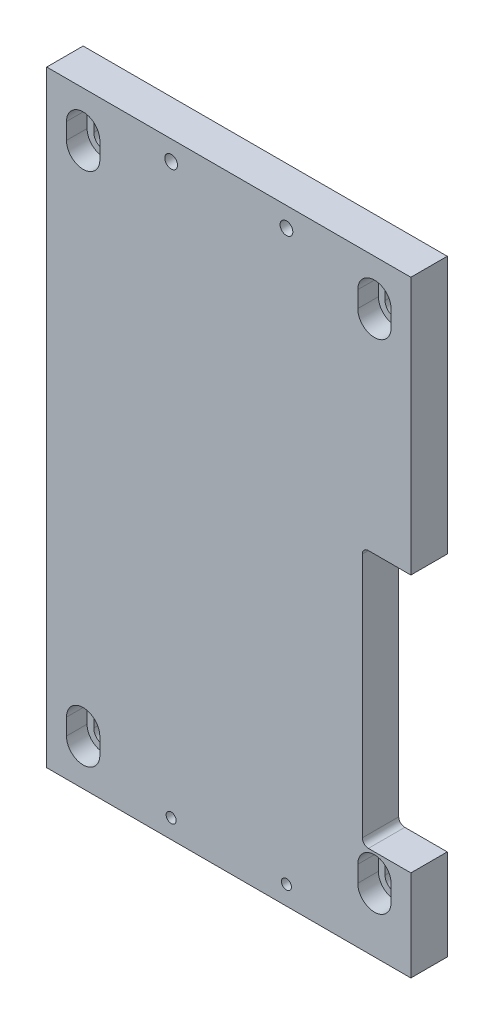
ISO-10303-21;
HEADER;
FILE_DESCRIPTION(('STEP AP214'),'2;1');
FILE_NAME('part.step','',(''),(''),'','','');
FILE_SCHEMA(('AUTOMOTIVE_DESIGN { 1 0 10303 214 1 1 1 1 }'));
ENDSEC;
DATA;
#1=APPLICATION_CONTEXT('core data for automotive mechanical design processes');
#2=APPLICATION_PROTOCOL_DEFINITION('international standard','automotive_design',2000,#1);
#3=PRODUCT_CONTEXT('',#1,'mechanical');
#4=PRODUCT('Part','Part','',(#3));
#5=PRODUCT_RELATED_PRODUCT_CATEGORY('part','',(#4));
#6=PRODUCT_DEFINITION_FORMATION('','',#4);
#7=PRODUCT_DEFINITION_CONTEXT('part definition',#1,'design');
#8=PRODUCT_DEFINITION('design','',#6,#7);
#9=PRODUCT_DEFINITION_SHAPE('','',#8);
#10=(LENGTH_UNIT() NAMED_UNIT(*) SI_UNIT(.MILLI.,.METRE.));
#11=(NAMED_UNIT(*) PLANE_ANGLE_UNIT() SI_UNIT($,.RADIAN.));
#12=(NAMED_UNIT(*) SI_UNIT($,.STERADIAN.) SOLID_ANGLE_UNIT());
#13=UNCERTAINTY_MEASURE_WITH_UNIT(LENGTH_MEASURE(1.E-05),#10,'distance_accuracy_value','');
#14=(GEOMETRIC_REPRESENTATION_CONTEXT(3) GLOBAL_UNCERTAINTY_ASSIGNED_CONTEXT((#13)) GLOBAL_UNIT_ASSIGNED_CONTEXT((#10,
#11,#12)) REPRESENTATION_CONTEXT('',''));
#15=CARTESIAN_POINT('',(0.,0.,0.));
#16=DIRECTION('',(0.,0.,1.));
#17=DIRECTION('',(1.,0.,0.));
#18=AXIS2_PLACEMENT_3D('',#15,#16,#17);
#19=CARTESIAN_POINT('',(0.,0.,12.));
#20=DIRECTION('',(0.,0.,1.));
#21=DIRECTION('',(1.,0.,0.));
#22=AXIS2_PLACEMENT_3D('',#19,#20,#21);
#23=PLANE('',#22);
#24=CARTESIAN_POINT('',(-48.,-82.3,12.));
#25=DIRECTION('',(0.,0.,1.));
#26=DIRECTION('',(1.,0.,0.));
#27=AXIS2_PLACEMENT_3D('',#24,#25,#26);
#28=CIRCLE('',#27,5.5);
#29=CARTESIAN_POINT('',(-42.5,-82.3,12.));
#30=VERTEX_POINT('',#29);
#31=CARTESIAN_POINT('',(-53.5,-82.3,12.));
#32=VERTEX_POINT('',#31);
#33=EDGE_CURVE('E389',#30,#32,#28,.T.);
#34=ORIENTED_EDGE('',*,*,#33,.F.);
#35=DIRECTION('',(0.,1.,0.));
#36=VECTOR('',#35,1.);
#37=CARTESIAN_POINT('',(-42.5,-87.7,12.));
#38=LINE('',#37,#36);
#39=CARTESIAN_POINT('',(-42.5,-87.7,12.));
#40=VERTEX_POINT('',#39);
#41=EDGE_CURVE('E343',#40,#30,#38,.T.);
#42=ORIENTED_EDGE('',*,*,#41,.F.);
#43=CARTESIAN_POINT('',(-48.,-87.7,12.));
#44=DIRECTION('',(0.,0.,1.));
#45=DIRECTION('',(1.,0.,0.));
#46=AXIS2_PLACEMENT_3D('',#43,#44,#45);
#47=CIRCLE('',#46,5.5);
#48=CARTESIAN_POINT('',(-53.5,-87.7,12.));
#49=VERTEX_POINT('',#48);
#50=EDGE_CURVE('E369',#49,#40,#47,.T.);
#51=ORIENTED_EDGE('',*,*,#50,.F.);
#52=DIRECTION('',(0.,1.,0.));
#53=VECTOR('',#52,1.);
#54=CARTESIAN_POINT('',(-53.5,-87.7,12.));
#55=LINE('',#54,#53);
#56=EDGE_CURVE('E358',#49,#32,#55,.T.);
#57=ORIENTED_EDGE('',*,*,#56,.T.);
#58=EDGE_LOOP('',(#34,#42,#51,#57));
#59=FACE_BOUND('',#58,.T.);
#60=CARTESIAN_POINT('',(48.,87.7,12.));
#61=DIRECTION('',(0.,0.,1.));
#62=DIRECTION('',(1.,0.,0.));
#63=AXIS2_PLACEMENT_3D('',#60,#61,#62);
#64=CIRCLE('',#63,5.5);
#65=CARTESIAN_POINT('',(53.5,87.7,12.));
#66=VERTEX_POINT('',#65);
#67=CARTESIAN_POINT('',(42.5,87.7,12.));
#68=VERTEX_POINT('',#67);
#69=EDGE_CURVE('E449',#66,#68,#64,.T.);
#70=ORIENTED_EDGE('',*,*,#69,.F.);
#71=DIRECTION('',(0.,1.,0.));
#72=VECTOR('',#71,1.);
#73=CARTESIAN_POINT('',(53.5,82.3,12.));
#74=LINE('',#73,#72);
#75=CARTESIAN_POINT('',(53.5,82.3,12.));
#76=VERTEX_POINT('',#75);
#77=EDGE_CURVE('E403',#76,#66,#74,.T.);
#78=ORIENTED_EDGE('',*,*,#77,.F.);
#79=CARTESIAN_POINT('',(48.,82.3,12.));
#80=DIRECTION('',(0.,0.,1.));
#81=DIRECTION('',(1.,0.,0.));
#82=AXIS2_PLACEMENT_3D('',#79,#80,#81);
#83=CIRCLE('',#82,5.5);
#84=CARTESIAN_POINT('',(42.5,82.3,12.));
#85=VERTEX_POINT('',#84);
#86=EDGE_CURVE('E429',#85,#76,#83,.T.);
#87=ORIENTED_EDGE('',*,*,#86,.F.);
#88=DIRECTION('',(0.,1.,0.));
#89=VECTOR('',#88,1.);
#90=CARTESIAN_POINT('',(42.5,82.3,12.));
#91=LINE('',#90,#89);
#92=EDGE_CURVE('E418',#85,#68,#91,.T.);
#93=ORIENTED_EDGE('',*,*,#92,.T.);
#94=EDGE_LOOP('',(#70,#78,#87,#93));
#95=FACE_BOUND('',#94,.T.);
#96=CARTESIAN_POINT('',(48.,-76.3,12.));
#97=DIRECTION('',(0.,0.,1.));
#98=DIRECTION('',(1.,0.,0.));
#99=AXIS2_PLACEMENT_3D('',#96,#97,#98);
#100=CIRCLE('',#99,5.5);
#101=CARTESIAN_POINT('',(53.5,-76.3,12.));
#102=VERTEX_POINT('',#101);
#103=CARTESIAN_POINT('',(42.5,-76.3,12.));
#104=VERTEX_POINT('',#103);
#105=EDGE_CURVE('E509',#102,#104,#100,.T.);
#106=ORIENTED_EDGE('',*,*,#105,.F.);
#107=DIRECTION('',(0.,1.,0.));
#108=VECTOR('',#107,1.);
#109=CARTESIAN_POINT('',(53.5,-81.7,12.));
#110=LINE('',#109,#108);
#111=CARTESIAN_POINT('',(53.5,-81.7,12.));
#112=VERTEX_POINT('',#111);
#113=EDGE_CURVE('E463',#112,#102,#110,.T.);
#114=ORIENTED_EDGE('',*,*,#113,.F.);
#115=CARTESIAN_POINT('',(48.,-81.7,12.));
#116=DIRECTION('',(0.,0.,1.));
#117=DIRECTION('',(1.,0.,0.));
#118=AXIS2_PLACEMENT_3D('',#115,#116,#117);
#119=CIRCLE('',#118,5.5);
#120=CARTESIAN_POINT('',(42.5,-81.7,12.));
#121=VERTEX_POINT('',#120);
#122=EDGE_CURVE('E489',#121,#112,#119,.T.);
#123=ORIENTED_EDGE('',*,*,#122,.F.);
#124=DIRECTION('',(0.,1.,0.));
#125=VECTOR('',#124,1.);
#126=CARTESIAN_POINT('',(42.5,-81.7,12.));
#127=LINE('',#126,#125);
#128=EDGE_CURVE('E478',#121,#104,#127,.T.);
#129=ORIENTED_EDGE('',*,*,#128,.T.);
#130=EDGE_LOOP('',(#106,#114,#123,#129));
#131=FACE_BOUND('',#130,.T.);
#132=CARTESIAN_POINT('',(-19.,-93.75,12.));
#133=DIRECTION('',(0.,0.,1.));
#134=DIRECTION('',(1.,0.,0.));
#135=AXIS2_PLACEMENT_3D('',#132,#133,#134);
#136=CIRCLE('',#135,1.65);
#137=CARTESIAN_POINT('',(-17.35,-93.75,12.));
#138=VERTEX_POINT('',#137);
#139=EDGE_CURVE('E523',#138,#138,#136,.T.);
#140=ORIENTED_EDGE('',*,*,#139,.F.);
#141=EDGE_LOOP('',(#140));
#142=FACE_BOUND('',#141,.T.);
#143=CARTESIAN_POINT('',(19.,-93.75,12.));
#144=DIRECTION('',(0.,0.,1.));
#145=DIRECTION('',(1.,0.,0.));
#146=AXIS2_PLACEMENT_3D('',#143,#144,#145);
#147=CIRCLE('',#146,1.65);
#148=CARTESIAN_POINT('',(20.65,-93.75,12.));
#149=VERTEX_POINT('',#148);
#150=EDGE_CURVE('E529',#149,#149,#147,.T.);
#151=ORIENTED_EDGE('',*,*,#150,.F.);
#152=EDGE_LOOP('',(#151));
#153=FACE_BOUND('',#152,.T.);
#154=CARTESIAN_POINT('',(-19.,93.5,12.));
#155=DIRECTION('',(0.,0.,1.));
#156=DIRECTION('',(1.,0.,0.));
#157=AXIS2_PLACEMENT_3D('',#154,#155,#156);
#158=CIRCLE('',#157,2.1);
#159=CARTESIAN_POINT('',(-16.9,93.5,12.));
#160=VERTEX_POINT('',#159);
#161=EDGE_CURVE('E535',#160,#160,#158,.T.);
#162=ORIENTED_EDGE('',*,*,#161,.F.);
#163=EDGE_LOOP('',(#162));
#164=FACE_BOUND('',#163,.T.);
#165=CARTESIAN_POINT('',(19.,93.5,12.));
#166=DIRECTION('',(0.,0.,1.));
#167=DIRECTION('',(1.,0.,0.));
#168=AXIS2_PLACEMENT_3D('',#165,#166,#167);
#169=CIRCLE('',#168,2.1);
#170=CARTESIAN_POINT('',(21.1,93.5,12.));
#171=VERTEX_POINT('',#170);
#172=EDGE_CURVE('E541',#171,#171,#169,.T.);
#173=ORIENTED_EDGE('',*,*,#172,.F.);
#174=EDGE_LOOP('',(#173));
#175=FACE_BOUND('',#174,.T.);
#176=DIRECTION('',(1.,0.,0.));
#177=VECTOR('',#176,1.);
#178=CARTESIAN_POINT('',(60.,-70.,12.));
#179=LINE('',#178,#177);
#180=CARTESIAN_POINT('',(46.,-70.,12.));
#181=VERTEX_POINT('',#180);
#182=CARTESIAN_POINT('',(60.,-70.,12.));
#183=VERTEX_POINT('',#182);
#184=EDGE_CURVE('E552',#181,#183,#179,.T.);
#185=ORIENTED_EDGE('',*,*,#184,.F.);
#186=CARTESIAN_POINT('',(46.,-68.,12.));
#187=DIRECTION('',(0.,0.,1.));
#188=DIRECTION('',(1.,0.,0.));
#189=AXIS2_PLACEMENT_3D('',#186,#187,#188);
#190=CIRCLE('',#189,2.);
#191=CARTESIAN_POINT('',(44.,-68.,12.));
#192=VERTEX_POINT('',#191);
#193=EDGE_CURVE('E573',#192,#181,#190,.T.);
#194=ORIENTED_EDGE('',*,*,#193,.F.);
#195=DIRECTION('',(0.,-1.,0.));
#196=VECTOR('',#195,1.);
#197=CARTESIAN_POINT('',(44.,-68.,12.));
#198=LINE('',#197,#196);
#199=CARTESIAN_POINT('',(44.,13.,12.));
#200=VERTEX_POINT('',#199);
#201=EDGE_CURVE('E570',#200,#192,#198,.T.);
#202=ORIENTED_EDGE('',*,*,#201,.F.);
#203=CARTESIAN_POINT('',(46.,13.,12.));
#204=DIRECTION('',(0.,0.,1.));
#205=DIRECTION('',(-1.,0.,0.));
#206=AXIS2_PLACEMENT_3D('',#203,#204,#205);
#207=CIRCLE('',#206,2.);
#208=CARTESIAN_POINT('',(46.,15.,12.));
#209=VERTEX_POINT('',#208);
#210=EDGE_CURVE('E567',#209,#200,#207,.T.);
#211=ORIENTED_EDGE('',*,*,#210,.F.);
#212=DIRECTION('',(-1.,0.,0.));
#213=VECTOR('',#212,1.);
#214=CARTESIAN_POINT('',(60.,15.,12.));
#215=LINE('',#214,#213);
#216=CARTESIAN_POINT('',(60.,15.,12.));
#217=VERTEX_POINT('',#216);
#218=EDGE_CURVE('E547',#217,#209,#215,.T.);
#219=ORIENTED_EDGE('',*,*,#218,.F.);
#220=DIRECTION('',(0.,1.,0.));
#221=VECTOR('',#220,1.);
#222=CARTESIAN_POINT('',(60.,100.,12.));
#223=LINE('',#222,#221);
#224=CARTESIAN_POINT('',(60.,100.,12.));
#225=VERTEX_POINT('',#224);
#226=EDGE_CURVE('E594',#217,#225,#223,.T.);
#227=ORIENTED_EDGE('',*,*,#226,.T.);
#228=DIRECTION('',(-1.,0.,0.));
#229=VECTOR('',#228,1.);
#230=CARTESIAN_POINT('',(-60.,100.,12.));
#231=LINE('',#230,#229);
#232=CARTESIAN_POINT('',(-60.,100.,12.));
#233=VERTEX_POINT('',#232);
#234=EDGE_CURVE('E593',#225,#233,#231,.T.);
#235=ORIENTED_EDGE('',*,*,#234,.T.);
#236=DIRECTION('',(0.,-1.,0.));
#237=VECTOR('',#236,1.);
#238=CARTESIAN_POINT('',(-60.,100.,12.));
#239=LINE('',#238,#237);
#240=CARTESIAN_POINT('',(-60.,-100.,12.));
#241=VERTEX_POINT('',#240);
#242=EDGE_CURVE('E596',#233,#241,#239,.T.);
#243=ORIENTED_EDGE('',*,*,#242,.T.);
#244=DIRECTION('',(1.,0.,0.));
#245=VECTOR('',#244,1.);
#246=CARTESIAN_POINT('',(-60.,-100.,12.));
#247=LINE('',#246,#245);
#248=CARTESIAN_POINT('',(60.,-100.,12.));
#249=VERTEX_POINT('',#248);
#250=EDGE_CURVE('E598',#241,#249,#247,.T.);
#251=ORIENTED_EDGE('',*,*,#250,.T.);
#252=EDGE_CURVE('E590',#249,#183,#223,.T.);
#253=ORIENTED_EDGE('',*,*,#252,.T.);
#254=EDGE_LOOP('',(#185,#194,#202,#211,#219,#227,#235,#243,#251,#253));
#255=FACE_BOUND('',#254,.T.);
#256=CARTESIAN_POINT('',(-48.,82.3,12.));
#257=DIRECTION('',(0.,0.,1.));
#258=DIRECTION('',(1.,0.,0.));
#259=AXIS2_PLACEMENT_3D('',#256,#257,#258);
#260=CIRCLE('',#259,5.5);
#261=CARTESIAN_POINT('',(-53.5,82.3,12.));
#262=VERTEX_POINT('',#261);
#263=CARTESIAN_POINT('',(-42.5,82.3,12.));
#264=VERTEX_POINT('',#263);
#265=EDGE_CURVE('E298',#262,#264,#260,.T.);
#266=ORIENTED_EDGE('',*,*,#265,.F.);
#267=DIRECTION('',(0.,1.,0.));
#268=VECTOR('',#267,1.);
#269=CARTESIAN_POINT('',(-53.5,82.3,12.));
#270=LINE('',#269,#268);
#271=CARTESIAN_POINT('',(-53.5,87.7,12.));
#272=VERTEX_POINT('',#271);
#273=EDGE_CURVE('E314',#262,#272,#270,.T.);
#274=ORIENTED_EDGE('',*,*,#273,.T.);
#275=CARTESIAN_POINT('',(-48.,87.7,12.));
#276=DIRECTION('',(0.,0.,1.));
#277=DIRECTION('',(1.,0.,0.));
#278=AXIS2_PLACEMENT_3D('',#275,#276,#277);
#279=CIRCLE('',#278,5.5);
#280=CARTESIAN_POINT('',(-42.5,87.7,12.));
#281=VERTEX_POINT('',#280);
#282=EDGE_CURVE('E330',#281,#272,#279,.T.);
#283=ORIENTED_EDGE('',*,*,#282,.F.);
#284=DIRECTION('',(0.,1.,0.));
#285=VECTOR('',#284,1.);
#286=CARTESIAN_POINT('',(-42.5,82.3,12.));
#287=LINE('',#286,#285);
#288=EDGE_CURVE('E305',#264,#281,#287,.T.);
#289=ORIENTED_EDGE('',*,*,#288,.F.);
#290=EDGE_LOOP('',(#266,#274,#283,#289));
#291=FACE_BOUND('',#290,.T.);
#292=ADVANCED_FACE('F16',(#59,#95,#131,#142,#153,#164,#175,#255,#291),#23,.T.);
#293=CARTESIAN_POINT('',(0.,0.,0.));
#294=DIRECTION('',(0.,0.,1.));
#295=DIRECTION('',(1.,0.,0.));
#296=AXIS2_PLACEMENT_3D('',#293,#294,#295);
#297=PLANE('',#296);
#298=DIRECTION('',(0.,1.,0.));
#299=VECTOR('',#298,1.);
#300=CARTESIAN_POINT('',(-44.7,82.3,0.));
#301=LINE('',#300,#299);
#302=CARTESIAN_POINT('',(-44.7,82.3,0.));
#303=VERTEX_POINT('',#302);
#304=CARTESIAN_POINT('',(-44.7,87.7,0.));
#305=VERTEX_POINT('',#304);
#306=EDGE_CURVE('E1163',#303,#305,#301,.T.);
#307=ORIENTED_EDGE('',*,*,#306,.T.);
#308=CARTESIAN_POINT('',(-48.,87.7,0.));
#309=DIRECTION('',(0.,0.,1.));
#310=DIRECTION('',(1.,0.,0.));
#311=AXIS2_PLACEMENT_3D('',#308,#309,#310);
#312=CIRCLE('',#311,3.3);
#313=CARTESIAN_POINT('',(-51.3,87.7,0.));
#314=VERTEX_POINT('',#313);
#315=EDGE_CURVE('E338',#305,#314,#312,.T.);
#316=ORIENTED_EDGE('',*,*,#315,.T.);
#317=DIRECTION('',(0.,1.,0.));
#318=VECTOR('',#317,1.);
#319=CARTESIAN_POINT('',(-51.3,82.3,0.));
#320=LINE('',#319,#318);
#321=CARTESIAN_POINT('',(-51.3,82.3,0.));
#322=VERTEX_POINT('',#321);
#323=EDGE_CURVE('E1166',#322,#314,#320,.T.);
#324=ORIENTED_EDGE('',*,*,#323,.F.);
#325=CARTESIAN_POINT('',(-48.,82.3,0.));
#326=DIRECTION('',(0.,0.,1.));
#327=DIRECTION('',(1.,0.,0.));
#328=AXIS2_PLACEMENT_3D('',#325,#326,#327);
#329=CIRCLE('',#328,3.3);
#330=EDGE_CURVE('E31',#322,#303,#329,.T.);
#331=ORIENTED_EDGE('',*,*,#330,.T.);
#332=EDGE_LOOP('',(#307,#316,#324,#331));
#333=FACE_BOUND('',#332,.T.);
#334=DIRECTION('',(0.,1.,0.));
#335=VECTOR('',#334,1.);
#336=CARTESIAN_POINT('',(-44.7,-87.7,0.));
#337=LINE('',#336,#335);
#338=CARTESIAN_POINT('',(-44.7,-87.7,0.));
#339=VERTEX_POINT('',#338);
#340=CARTESIAN_POINT('',(-44.7,-82.3,0.));
#341=VERTEX_POINT('',#340);
#342=EDGE_CURVE('E349',#339,#341,#337,.T.);
#343=ORIENTED_EDGE('',*,*,#342,.T.);
#344=CARTESIAN_POINT('',(-48.,-82.3,0.));
#345=DIRECTION('',(0.,0.,1.));
#346=DIRECTION('',(1.,0.,0.));
#347=AXIS2_PLACEMENT_3D('',#344,#345,#346);
#348=CIRCLE('',#347,3.3);
#349=CARTESIAN_POINT('',(-51.3,-82.3,0.));
#350=VERTEX_POINT('',#349);
#351=EDGE_CURVE('E398',#341,#350,#348,.T.);
#352=ORIENTED_EDGE('',*,*,#351,.T.);
#353=DIRECTION('',(0.,1.,0.));
#354=VECTOR('',#353,1.);
#355=CARTESIAN_POINT('',(-51.3,-87.7,0.));
#356=LINE('',#355,#354);
#357=CARTESIAN_POINT('',(-51.3,-87.7,0.));
#358=VERTEX_POINT('',#357);
#359=EDGE_CURVE('E352',#358,#350,#356,.T.);
#360=ORIENTED_EDGE('',*,*,#359,.F.);
#361=CARTESIAN_POINT('',(-48.,-87.7,0.));
#362=DIRECTION('',(0.,0.,1.));
#363=DIRECTION('',(1.,0.,0.));
#364=AXIS2_PLACEMENT_3D('',#361,#362,#363);
#365=CIRCLE('',#364,3.3);
#366=EDGE_CURVE('E376',#358,#339,#365,.T.);
#367=ORIENTED_EDGE('',*,*,#366,.T.);
#368=EDGE_LOOP('',(#343,#352,#360,#367));
#369=FACE_BOUND('',#368,.T.);
#370=DIRECTION('',(0.,1.,0.));
#371=VECTOR('',#370,1.);
#372=CARTESIAN_POINT('',(51.3,82.3,0.));
#373=LINE('',#372,#371);
#374=CARTESIAN_POINT('',(51.3,82.3,0.));
#375=VERTEX_POINT('',#374);
#376=CARTESIAN_POINT('',(51.3,87.7,0.));
#377=VERTEX_POINT('',#376);
#378=EDGE_CURVE('E409',#375,#377,#373,.T.);
#379=ORIENTED_EDGE('',*,*,#378,.T.);
#380=CARTESIAN_POINT('',(48.,87.7,0.));
#381=DIRECTION('',(0.,0.,1.));
#382=DIRECTION('',(1.,0.,0.));
#383=AXIS2_PLACEMENT_3D('',#380,#381,#382);
#384=CIRCLE('',#383,3.3);
#385=CARTESIAN_POINT('',(44.7,87.7,0.));
#386=VERTEX_POINT('',#385);
#387=EDGE_CURVE('E458',#377,#386,#384,.T.);
#388=ORIENTED_EDGE('',*,*,#387,.T.);
#389=DIRECTION('',(0.,1.,0.));
#390=VECTOR('',#389,1.);
#391=CARTESIAN_POINT('',(44.7,82.3,0.));
#392=LINE('',#391,#390);
#393=CARTESIAN_POINT('',(44.7,82.3,0.));
#394=VERTEX_POINT('',#393);
#395=EDGE_CURVE('E412',#394,#386,#392,.T.);
#396=ORIENTED_EDGE('',*,*,#395,.F.);
#397=CARTESIAN_POINT('',(48.,82.3,0.));
#398=DIRECTION('',(0.,0.,1.));
#399=DIRECTION('',(1.,0.,0.));
#400=AXIS2_PLACEMENT_3D('',#397,#398,#399);
#401=CIRCLE('',#400,3.3);
#402=EDGE_CURVE('E436',#394,#375,#401,.T.);
#403=ORIENTED_EDGE('',*,*,#402,.T.);
#404=EDGE_LOOP('',(#379,#388,#396,#403));
#405=FACE_BOUND('',#404,.T.);
#406=CARTESIAN_POINT('',(46.,-68.,0.));
#407=DIRECTION('',(0.,0.,1.));
#408=DIRECTION('',(1.,0.,0.));
#409=AXIS2_PLACEMENT_3D('',#406,#407,#408);
#410=CIRCLE('',#409,2.);
#411=CARTESIAN_POINT('',(44.,-68.,0.));
#412=VERTEX_POINT('',#411);
#413=CARTESIAN_POINT('',(46.,-70.,0.));
#414=VERTEX_POINT('',#413);
#415=EDGE_CURVE('E558',#412,#414,#410,.T.);
#416=ORIENTED_EDGE('',*,*,#415,.T.);
#417=DIRECTION('',(1.,0.,0.));
#418=VECTOR('',#417,1.);
#419=CARTESIAN_POINT('',(60.,-70.,0.));
#420=LINE('',#419,#418);
#421=CARTESIAN_POINT('',(60.,-70.,0.));
#422=VERTEX_POINT('',#421);
#423=EDGE_CURVE('E561',#414,#422,#420,.T.);
#424=ORIENTED_EDGE('',*,*,#423,.T.);
#425=DIRECTION('',(0.,1.,0.));
#426=VECTOR('',#425,1.);
#427=CARTESIAN_POINT('',(60.,100.,0.));
#428=LINE('',#427,#426);
#429=CARTESIAN_POINT('',(60.,-100.,0.));
#430=VERTEX_POINT('',#429);
#431=EDGE_CURVE('E601',#430,#422,#428,.T.);
#432=ORIENTED_EDGE('',*,*,#431,.F.);
#433=DIRECTION('',(1.,0.,0.));
#434=VECTOR('',#433,1.);
#435=CARTESIAN_POINT('',(-60.,-100.,0.));
#436=LINE('',#435,#434);
#437=CARTESIAN_POINT('',(-60.,-100.,0.));
#438=VERTEX_POINT('',#437);
#439=EDGE_CURVE('E608',#438,#430,#436,.T.);
#440=ORIENTED_EDGE('',*,*,#439,.F.);
#441=DIRECTION('',(0.,-1.,0.));
#442=VECTOR('',#441,1.);
#443=CARTESIAN_POINT('',(-60.,100.,0.));
#444=LINE('',#443,#442);
#445=CARTESIAN_POINT('',(-60.,100.,0.));
#446=VERTEX_POINT('',#445);
#447=EDGE_CURVE('E606',#446,#438,#444,.T.);
#448=ORIENTED_EDGE('',*,*,#447,.F.);
#449=DIRECTION('',(-1.,0.,0.));
#450=VECTOR('',#449,1.);
#451=CARTESIAN_POINT('',(-60.,100.,0.));
#452=LINE('',#451,#450);
#453=CARTESIAN_POINT('',(60.,100.,0.));
#454=VERTEX_POINT('',#453);
#455=EDGE_CURVE('E604',#454,#446,#452,.T.);
#456=ORIENTED_EDGE('',*,*,#455,.F.);
#457=CARTESIAN_POINT('',(60.,15.,0.));
#458=VERTEX_POINT('',#457);
#459=EDGE_CURVE('E580',#458,#454,#428,.T.);
#460=ORIENTED_EDGE('',*,*,#459,.F.);
#461=DIRECTION('',(-1.,0.,0.));
#462=VECTOR('',#461,1.);
#463=CARTESIAN_POINT('',(60.,15.,0.));
#464=LINE('',#463,#462);
#465=CARTESIAN_POINT('',(46.,15.,0.));
#466=VERTEX_POINT('',#465);
#467=EDGE_CURVE('E548',#458,#466,#464,.T.);
#468=ORIENTED_EDGE('',*,*,#467,.T.);
#469=CARTESIAN_POINT('',(46.,13.,0.));
#470=DIRECTION('',(0.,0.,1.));
#471=DIRECTION('',(-1.,0.,0.));
#472=AXIS2_PLACEMENT_3D('',#469,#470,#471);
#473=CIRCLE('',#472,2.);
#474=CARTESIAN_POINT('',(44.,13.,0.));
#475=VERTEX_POINT('',#474);
#476=EDGE_CURVE('E551',#466,#475,#473,.T.);
#477=ORIENTED_EDGE('',*,*,#476,.T.);
#478=DIRECTION('',(0.,-1.,0.));
#479=VECTOR('',#478,1.);
#480=CARTESIAN_POINT('',(44.,-68.,0.));
#481=LINE('',#480,#479);
#482=EDGE_CURVE('E555',#475,#412,#481,.T.);
#483=ORIENTED_EDGE('',*,*,#482,.T.);
#484=EDGE_LOOP('',(#416,#424,#432,#440,#448,#456,#460,#468,#477,#483));
#485=FACE_BOUND('',#484,.T.);
#486=CARTESIAN_POINT('',(19.,93.5,0.));
#487=DIRECTION('',(0.,0.,1.));
#488=DIRECTION('',(1.,0.,0.));
#489=AXIS2_PLACEMENT_3D('',#486,#487,#488);
#490=CIRCLE('',#489,2.1);
#491=CARTESIAN_POINT('',(21.1,93.5,0.));
#492=VERTEX_POINT('',#491);
#493=EDGE_CURVE('E544',#492,#492,#490,.T.);
#494=ORIENTED_EDGE('',*,*,#493,.T.);
#495=EDGE_LOOP('',(#494));
#496=FACE_BOUND('',#495,.T.);
#497=CARTESIAN_POINT('',(-19.,93.5,0.));
#498=DIRECTION('',(0.,0.,1.));
#499=DIRECTION('',(1.,0.,0.));
#500=AXIS2_PLACEMENT_3D('',#497,#498,#499);
#501=CIRCLE('',#500,2.1);
#502=CARTESIAN_POINT('',(-16.9,93.5,0.));
#503=VERTEX_POINT('',#502);
#504=EDGE_CURVE('E538',#503,#503,#501,.T.);
#505=ORIENTED_EDGE('',*,*,#504,.T.);
#506=EDGE_LOOP('',(#505));
#507=FACE_BOUND('',#506,.T.);
#508=CARTESIAN_POINT('',(19.,-93.75,0.));
#509=DIRECTION('',(0.,0.,1.));
#510=DIRECTION('',(1.,0.,0.));
#511=AXIS2_PLACEMENT_3D('',#508,#509,#510);
#512=CIRCLE('',#511,1.65);
#513=CARTESIAN_POINT('',(20.65,-93.75,0.));
#514=VERTEX_POINT('',#513);
#515=EDGE_CURVE('E532',#514,#514,#512,.T.);
#516=ORIENTED_EDGE('',*,*,#515,.T.);
#517=EDGE_LOOP('',(#516));
#518=FACE_BOUND('',#517,.T.);
#519=CARTESIAN_POINT('',(-19.,-93.75,0.));
#520=DIRECTION('',(0.,0.,1.));
#521=DIRECTION('',(1.,0.,0.));
#522=AXIS2_PLACEMENT_3D('',#519,#520,#521);
#523=CIRCLE('',#522,1.65);
#524=CARTESIAN_POINT('',(-17.35,-93.75,0.));
#525=VERTEX_POINT('',#524);
#526=EDGE_CURVE('E526',#525,#525,#523,.T.);
#527=ORIENTED_EDGE('',*,*,#526,.T.);
#528=EDGE_LOOP('',(#527));
#529=FACE_BOUND('',#528,.T.);
#530=DIRECTION('',(0.,1.,0.));
#531=VECTOR('',#530,1.);
#532=CARTESIAN_POINT('',(44.7,-81.7,0.));
#533=LINE('',#532,#531);
#534=CARTESIAN_POINT('',(44.7,-81.7,0.));
#535=VERTEX_POINT('',#534);
#536=CARTESIAN_POINT('',(44.7,-76.3,0.));
#537=VERTEX_POINT('',#536);
#538=EDGE_CURVE('E472',#535,#537,#533,.T.);
#539=ORIENTED_EDGE('',*,*,#538,.F.);
#540=CARTESIAN_POINT('',(48.,-81.7,0.));
#541=DIRECTION('',(0.,0.,1.));
#542=DIRECTION('',(1.,0.,0.));
#543=AXIS2_PLACEMENT_3D('',#540,#541,#542);
#544=CIRCLE('',#543,3.3);
#545=CARTESIAN_POINT('',(51.3,-81.7,0.));
#546=VERTEX_POINT('',#545);
#547=EDGE_CURVE('E496',#535,#546,#544,.T.);
#548=ORIENTED_EDGE('',*,*,#547,.T.);
#549=DIRECTION('',(0.,1.,0.));
#550=VECTOR('',#549,1.);
#551=CARTESIAN_POINT('',(51.3,-81.7,0.));
#552=LINE('',#551,#550);
#553=CARTESIAN_POINT('',(51.3,-76.3,0.));
#554=VERTEX_POINT('',#553);
#555=EDGE_CURVE('E469',#546,#554,#552,.T.);
#556=ORIENTED_EDGE('',*,*,#555,.T.);
#557=CARTESIAN_POINT('',(48.,-76.3,0.));
#558=DIRECTION('',(0.,0.,1.));
#559=DIRECTION('',(1.,0.,0.));
#560=AXIS2_PLACEMENT_3D('',#557,#558,#559);
#561=CIRCLE('',#560,3.3);
#562=EDGE_CURVE('E518',#554,#537,#561,.T.);
#563=ORIENTED_EDGE('',*,*,#562,.T.);
#564=EDGE_LOOP('',(#539,#548,#556,#563));
#565=FACE_BOUND('',#564,.T.);
#566=ADVANCED_FACE('F626',(#333,#369,#405,#485,#496,#507,#518,#529,#565),#297,.F.);
#567=CARTESIAN_POINT('',(60.,100.,12.));
#568=DIRECTION('',(-1.,0.,0.));
#569=DIRECTION('',(0.,-1.,0.));
#570=AXIS2_PLACEMENT_3D('',#567,#568,#569);
#571=PLANE('',#570);
#572=ORIENTED_EDGE('',*,*,#431,.T.);
#573=DIRECTION('',(0.,0.,1.));
#574=VECTOR('',#573,1.);
#575=CARTESIAN_POINT('',(60.,-70.,0.));
#576=LINE('',#575,#574);
#577=EDGE_CURVE('E577',#422,#183,#576,.T.);
#578=ORIENTED_EDGE('',*,*,#577,.T.);
#579=ORIENTED_EDGE('',*,*,#252,.F.);
#580=DIRECTION('',(0.,0.,-1.));
#581=VECTOR('',#580,1.);
#582=CARTESIAN_POINT('',(60.,-100.,12.));
#583=LINE('',#582,#581);
#584=EDGE_CURVE('E600',#249,#430,#583,.T.);
#585=ORIENTED_EDGE('',*,*,#584,.T.);
#586=EDGE_LOOP('',(#572,#578,#579,#585));
#587=FACE_BOUND('',#586,.T.);
#588=ADVANCED_FACE('F636',(#587),#571,.F.);
#589=ORIENTED_EDGE('',*,*,#226,.F.);
#590=DIRECTION('',(0.,0.,1.));
#591=VECTOR('',#590,1.);
#592=CARTESIAN_POINT('',(60.,15.,0.));
#593=LINE('',#592,#591);
#594=EDGE_CURVE('E564',#458,#217,#593,.T.);
#595=ORIENTED_EDGE('',*,*,#594,.F.);
#596=ORIENTED_EDGE('',*,*,#459,.T.);
#597=DIRECTION('',(0.,0.,-1.));
#598=VECTOR('',#597,1.);
#599=CARTESIAN_POINT('',(60.,100.,12.));
#600=LINE('',#599,#598);
#601=EDGE_CURVE('E11',#225,#454,#600,.T.);
#602=ORIENTED_EDGE('',*,*,#601,.F.);
#603=EDGE_LOOP('',(#589,#595,#596,#602));
#604=FACE_BOUND('',#603,.T.);
#605=ADVANCED_FACE('F18',(#604),#571,.F.);
#606=CARTESIAN_POINT('',(-60.,100.,12.));
#607=DIRECTION('',(0.,-1.,0.));
#608=DIRECTION('',(0.,0.,-1.));
#609=AXIS2_PLACEMENT_3D('',#606,#607,#608);
#610=PLANE('',#609);
#611=ORIENTED_EDGE('',*,*,#455,.T.);
#612=DIRECTION('',(0.,0.,-1.));
#613=VECTOR('',#612,1.);
#614=CARTESIAN_POINT('',(-60.,100.,12.));
#615=LINE('',#614,#613);
#616=EDGE_CURVE('E24',#233,#446,#615,.T.);
#617=ORIENTED_EDGE('',*,*,#616,.F.);
#618=ORIENTED_EDGE('',*,*,#234,.F.);
#619=ORIENTED_EDGE('',*,*,#601,.T.);
#620=EDGE_LOOP('',(#611,#617,#618,#619));
#621=FACE_BOUND('',#620,.T.);
#622=ADVANCED_FACE('F644',(#621),#610,.F.);
#623=CARTESIAN_POINT('',(-60.,100.,12.));
#624=DIRECTION('',(1.,0.,0.));
#625=DIRECTION('',(0.,1.,0.));
#626=AXIS2_PLACEMENT_3D('',#623,#624,#625);
#627=PLANE('',#626);
#628=ORIENTED_EDGE('',*,*,#447,.T.);
#629=DIRECTION('',(0.,0.,-1.));
#630=VECTOR('',#629,1.);
#631=CARTESIAN_POINT('',(-60.,-100.,12.));
#632=LINE('',#631,#630);
#633=EDGE_CURVE('E612',#241,#438,#632,.T.);
#634=ORIENTED_EDGE('',*,*,#633,.F.);
#635=ORIENTED_EDGE('',*,*,#242,.F.);
#636=ORIENTED_EDGE('',*,*,#616,.T.);
#637=EDGE_LOOP('',(#628,#634,#635,#636));
#638=FACE_BOUND('',#637,.T.);
#639=ADVANCED_FACE('F619',(#638),#627,.F.);
#640=CARTESIAN_POINT('',(-60.,-100.,12.));
#641=DIRECTION('',(0.,1.,0.));
#642=DIRECTION('',(0.,0.,1.));
#643=AXIS2_PLACEMENT_3D('',#640,#641,#642);
#644=PLANE('',#643);
#645=ORIENTED_EDGE('',*,*,#439,.T.);
#646=ORIENTED_EDGE('',*,*,#584,.F.);
#647=ORIENTED_EDGE('',*,*,#250,.F.);
#648=ORIENTED_EDGE('',*,*,#633,.T.);
#649=EDGE_LOOP('',(#645,#646,#647,#648));
#650=FACE_BOUND('',#649,.T.);
#651=ADVANCED_FACE('F632',(#650),#644,.F.);
#652=CARTESIAN_POINT('',(60.,-70.,0.));
#653=DIRECTION('',(0.,-1.,0.));
#654=DIRECTION('',(1.,0.,0.));
#655=AXIS2_PLACEMENT_3D('',#652,#653,#654);
#656=PLANE('',#655);
#657=ORIENTED_EDGE('',*,*,#184,.T.);
#658=ORIENTED_EDGE('',*,*,#577,.F.);
#659=ORIENTED_EDGE('',*,*,#423,.F.);
#660=DIRECTION('',(0.,0.,1.));
#661=VECTOR('',#660,1.);
#662=CARTESIAN_POINT('',(46.,-70.,0.));
#663=LINE('',#662,#661);
#664=EDGE_CURVE('E581',#414,#181,#663,.T.);
#665=ORIENTED_EDGE('',*,*,#664,.T.);
#666=EDGE_LOOP('',(#657,#658,#659,#665));
#667=FACE_BOUND('',#666,.T.);
#668=ADVANCED_FACE('F662',(#667),#656,.F.);
#669=CARTESIAN_POINT('',(46.,-68.,0.));
#670=DIRECTION('',(0.,0.,1.));
#671=DIRECTION('',(1.,0.,0.));
#672=AXIS2_PLACEMENT_3D('',#669,#670,#671);
#673=CYLINDRICAL_SURFACE('',#672,2.);
#674=ORIENTED_EDGE('',*,*,#193,.T.);
#675=ORIENTED_EDGE('',*,*,#664,.F.);
#676=ORIENTED_EDGE('',*,*,#415,.F.);
#677=DIRECTION('',(0.,0.,1.));
#678=VECTOR('',#677,1.);
#679=CARTESIAN_POINT('',(44.,-68.,0.));
#680=LINE('',#679,#678);
#681=EDGE_CURVE('E583',#412,#192,#680,.T.);
#682=ORIENTED_EDGE('',*,*,#681,.T.);
#683=EDGE_LOOP('',(#674,#675,#676,#682));
#684=FACE_BOUND('',#683,.T.);
#685=ADVANCED_FACE('F660',(#684),#673,.F.);
#686=CARTESIAN_POINT('',(44.,-68.,0.));
#687=DIRECTION('',(-1.,0.,0.));
#688=DIRECTION('',(0.,-1.,0.));
#689=AXIS2_PLACEMENT_3D('',#686,#687,#688);
#690=PLANE('',#689);
#691=ORIENTED_EDGE('',*,*,#201,.T.);
#692=ORIENTED_EDGE('',*,*,#681,.F.);
#693=ORIENTED_EDGE('',*,*,#482,.F.);
#694=DIRECTION('',(0.,0.,1.));
#695=VECTOR('',#694,1.);
#696=CARTESIAN_POINT('',(44.,13.,0.));
#697=LINE('',#696,#695);
#698=EDGE_CURVE('E585',#475,#200,#697,.T.);
#699=ORIENTED_EDGE('',*,*,#698,.T.);
#700=EDGE_LOOP('',(#691,#692,#693,#699));
#701=FACE_BOUND('',#700,.T.);
#702=ADVANCED_FACE('F656',(#701),#690,.F.);
#703=CARTESIAN_POINT('',(46.,13.,0.));
#704=DIRECTION('',(0.,0.,1.));
#705=DIRECTION('',(1.,0.,0.));
#706=AXIS2_PLACEMENT_3D('',#703,#704,#705);
#707=CYLINDRICAL_SURFACE('',#706,2.);
#708=ORIENTED_EDGE('',*,*,#210,.T.);
#709=ORIENTED_EDGE('',*,*,#698,.F.);
#710=ORIENTED_EDGE('',*,*,#476,.F.);
#711=DIRECTION('',(0.,0.,1.));
#712=VECTOR('',#711,1.);
#713=CARTESIAN_POINT('',(46.,15.,0.));
#714=LINE('',#713,#712);
#715=EDGE_CURVE('E587',#466,#209,#714,.T.);
#716=ORIENTED_EDGE('',*,*,#715,.T.);
#717=EDGE_LOOP('',(#708,#709,#710,#716));
#718=FACE_BOUND('',#717,.T.);
#719=ADVANCED_FACE('F652',(#718),#707,.F.);
#720=CARTESIAN_POINT('',(60.,15.,0.));
#721=DIRECTION('',(0.,1.,0.));
#722=DIRECTION('',(0.,0.,1.));
#723=AXIS2_PLACEMENT_3D('',#720,#721,#722);
#724=PLANE('',#723);
#725=ORIENTED_EDGE('',*,*,#218,.T.);
#726=ORIENTED_EDGE('',*,*,#715,.F.);
#727=ORIENTED_EDGE('',*,*,#467,.F.);
#728=ORIENTED_EDGE('',*,*,#594,.T.);
#729=EDGE_LOOP('',(#725,#726,#727,#728));
#730=FACE_BOUND('',#729,.T.);
#731=ADVANCED_FACE('F649',(#730),#724,.F.);
#732=CARTESIAN_POINT('',(19.,93.5,12.));
#733=DIRECTION('',(0.,0.,1.));
#734=DIRECTION('',(1.,0.,0.));
#735=AXIS2_PLACEMENT_3D('',#732,#733,#734);
#736=CYLINDRICAL_SURFACE('',#735,2.1);
#737=ORIENTED_EDGE('',*,*,#493,.F.);
#738=EDGE_LOOP('',(#737));
#739=FACE_BOUND('',#738,.T.);
#740=ORIENTED_EDGE('',*,*,#172,.T.);
#741=EDGE_LOOP('',(#740));
#742=FACE_BOUND('',#741,.T.);
#743=ADVANCED_FACE('F809',(#739,#742),#736,.F.);
#744=CARTESIAN_POINT('',(-19.,93.5,12.));
#745=DIRECTION('',(0.,0.,1.));
#746=DIRECTION('',(1.,0.,0.));
#747=AXIS2_PLACEMENT_3D('',#744,#745,#746);
#748=CYLINDRICAL_SURFACE('',#747,2.1);
#749=ORIENTED_EDGE('',*,*,#504,.F.);
#750=EDGE_LOOP('',(#749));
#751=FACE_BOUND('',#750,.T.);
#752=ORIENTED_EDGE('',*,*,#161,.T.);
#753=EDGE_LOOP('',(#752));
#754=FACE_BOUND('',#753,.T.);
#755=ADVANCED_FACE('F801',(#751,#754),#748,.F.);
#756=CARTESIAN_POINT('',(19.,-93.75,12.));
#757=DIRECTION('',(0.,0.,1.));
#758=DIRECTION('',(1.,0.,0.));
#759=AXIS2_PLACEMENT_3D('',#756,#757,#758);
#760=CYLINDRICAL_SURFACE('',#759,1.65);
#761=ORIENTED_EDGE('',*,*,#515,.F.);
#762=EDGE_LOOP('',(#761));
#763=FACE_BOUND('',#762,.T.);
#764=ORIENTED_EDGE('',*,*,#150,.T.);
#765=EDGE_LOOP('',(#764));
#766=FACE_BOUND('',#765,.T.);
#767=ADVANCED_FACE('F792',(#763,#766),#760,.F.);
#768=CARTESIAN_POINT('',(-19.,-93.75,12.));
#769=DIRECTION('',(0.,0.,1.));
#770=DIRECTION('',(1.,0.,0.));
#771=AXIS2_PLACEMENT_3D('',#768,#769,#770);
#772=CYLINDRICAL_SURFACE('',#771,1.65);
#773=ORIENTED_EDGE('',*,*,#526,.F.);
#774=EDGE_LOOP('',(#773));
#775=FACE_BOUND('',#774,.T.);
#776=ORIENTED_EDGE('',*,*,#139,.T.);
#777=EDGE_LOOP('',(#776));
#778=FACE_BOUND('',#777,.T.);
#779=ADVANCED_FACE('F786',(#775,#778),#772,.F.);
#780=CARTESIAN_POINT('',(48.,-76.3,12.));
#781=DIRECTION('',(0.,0.,1.));
#782=DIRECTION('',(1.,0.,0.));
#783=AXIS2_PLACEMENT_3D('',#780,#781,#782);
#784=CYLINDRICAL_SURFACE('',#783,3.3);
#785=ORIENTED_EDGE('',*,*,#562,.F.);
#786=DIRECTION('',(0.,0.,-1.));
#787=VECTOR('',#786,1.);
#788=CARTESIAN_POINT('',(51.3,-76.3,0.));
#789=LINE('',#788,#787);
#790=CARTESIAN_POINT('',(51.3,-76.3,5.2));
#791=VERTEX_POINT('',#790);
#792=EDGE_CURVE('E507',#791,#554,#789,.T.);
#793=ORIENTED_EDGE('',*,*,#792,.F.);
#794=CARTESIAN_POINT('',(48.,-76.3,5.2));
#795=DIRECTION('',(0.,0.,1.));
#796=DIRECTION('',(1.,0.,0.));
#797=AXIS2_PLACEMENT_3D('',#794,#795,#796);
#798=CIRCLE('',#797,3.3);
#799=CARTESIAN_POINT('',(44.7,-76.3,5.2));
#800=VERTEX_POINT('',#799);
#801=EDGE_CURVE('E515',#791,#800,#798,.T.);
#802=ORIENTED_EDGE('',*,*,#801,.T.);
#803=DIRECTION('',(0.,0.,1.));
#804=VECTOR('',#803,1.);
#805=CARTESIAN_POINT('',(44.7,-76.3,12.));
#806=LINE('',#805,#804);
#807=EDGE_CURVE('E501',#537,#800,#806,.T.);
#808=ORIENTED_EDGE('',*,*,#807,.F.);
#809=EDGE_LOOP('',(#785,#793,#802,#808));
#810=FACE_BOUND('',#809,.T.);
#811=ADVANCED_FACE('F791',(#810),#784,.F.);
#812=CARTESIAN_POINT('',(51.3,-76.3,5.2));
#813=DIRECTION('',(0.,0.,-1.));
#814=DIRECTION('',(-1.,0.,0.));
#815=AXIS2_PLACEMENT_3D('',#812,#813,#814);
#816=PLANE('',#815);
#817=DIRECTION('',(0.,1.,0.));
#818=VECTOR('',#817,1.);
#819=CARTESIAN_POINT('',(42.5,-81.7,5.2));
#820=LINE('',#819,#818);
#821=CARTESIAN_POINT('',(42.5,-81.7,5.2));
#822=VERTEX_POINT('',#821);
#823=CARTESIAN_POINT('',(42.5,-76.3,5.2));
#824=VERTEX_POINT('',#823);
#825=EDGE_CURVE('E476',#822,#824,#820,.T.);
#826=ORIENTED_EDGE('',*,*,#825,.F.);
#827=CARTESIAN_POINT('',(48.,-81.7,5.2));
#828=DIRECTION('',(0.,0.,1.));
#829=DIRECTION('',(1.,0.,0.));
#830=AXIS2_PLACEMENT_3D('',#827,#828,#829);
#831=CIRCLE('',#830,5.5);
#832=CARTESIAN_POINT('',(53.5,-81.7,5.2));
#833=VERTEX_POINT('',#832);
#834=EDGE_CURVE('E492',#822,#833,#831,.T.);
#835=ORIENTED_EDGE('',*,*,#834,.T.);
#836=DIRECTION('',(0.,1.,0.));
#837=VECTOR('',#836,1.);
#838=CARTESIAN_POINT('',(53.5,-81.7,5.2));
#839=LINE('',#838,#837);
#840=CARTESIAN_POINT('',(53.5,-76.3,5.2));
#841=VERTEX_POINT('',#840);
#842=EDGE_CURVE('E465',#833,#841,#839,.T.);
#843=ORIENTED_EDGE('',*,*,#842,.T.);
#844=CARTESIAN_POINT('',(48.,-76.3,5.2));
#845=DIRECTION('',(0.,0.,1.));
#846=DIRECTION('',(1.,0.,0.));
#847=AXIS2_PLACEMENT_3D('',#844,#845,#846);
#848=CIRCLE('',#847,5.5);
#849=EDGE_CURVE('E512',#841,#824,#848,.T.);
#850=ORIENTED_EDGE('',*,*,#849,.T.);
#851=EDGE_LOOP('',(#826,#835,#843,#850));
#852=FACE_BOUND('',#851,.T.);
#853=ORIENTED_EDGE('',*,*,#801,.F.);
#854=DIRECTION('',(0.,1.,0.));
#855=VECTOR('',#854,1.);
#856=CARTESIAN_POINT('',(51.3,-81.7,5.2));
#857=LINE('',#856,#855);
#858=CARTESIAN_POINT('',(51.3,-81.7,5.2));
#859=VERTEX_POINT('',#858);
#860=EDGE_CURVE('E467',#859,#791,#857,.T.);
#861=ORIENTED_EDGE('',*,*,#860,.F.);
#862=CARTESIAN_POINT('',(48.,-81.7,5.2));
#863=DIRECTION('',(0.,0.,1.));
#864=DIRECTION('',(1.,0.,0.));
#865=AXIS2_PLACEMENT_3D('',#862,#863,#864);
#866=CIRCLE('',#865,3.3);
#867=CARTESIAN_POINT('',(44.7,-81.7,5.2));
#868=VERTEX_POINT('',#867);
#869=EDGE_CURVE('E494',#868,#859,#866,.T.);
#870=ORIENTED_EDGE('',*,*,#869,.F.);
#871=DIRECTION('',(0.,1.,0.));
#872=VECTOR('',#871,1.);
#873=CARTESIAN_POINT('',(44.7,-81.7,5.2));
#874=LINE('',#873,#872);
#875=EDGE_CURVE('E474',#868,#800,#874,.T.);
#876=ORIENTED_EDGE('',*,*,#875,.T.);
#877=EDGE_LOOP('',(#853,#861,#870,#876));
#878=FACE_BOUND('',#877,.T.);
#879=ADVANCED_FACE('F858',(#852,#878),#816,.F.);
#880=CARTESIAN_POINT('',(48.,-76.3,12.));
#881=DIRECTION('',(0.,0.,1.));
#882=DIRECTION('',(1.,0.,0.));
#883=AXIS2_PLACEMENT_3D('',#880,#881,#882);
#884=CYLINDRICAL_SURFACE('',#883,5.5);
#885=ORIENTED_EDGE('',*,*,#849,.F.);
#886=DIRECTION('',(0.,0.,-1.));
#887=VECTOR('',#886,1.);
#888=CARTESIAN_POINT('',(53.5,-76.3,5.2));
#889=LINE('',#888,#887);
#890=EDGE_CURVE('E504',#102,#841,#889,.T.);
#891=ORIENTED_EDGE('',*,*,#890,.F.);
#892=ORIENTED_EDGE('',*,*,#105,.T.);
#893=DIRECTION('',(0.,0.,1.));
#894=VECTOR('',#893,1.);
#895=CARTESIAN_POINT('',(42.5,-76.3,12.));
#896=LINE('',#895,#894);
#897=EDGE_CURVE('E521',#824,#104,#896,.T.);
#898=ORIENTED_EDGE('',*,*,#897,.F.);
#899=EDGE_LOOP('',(#885,#891,#892,#898));
#900=FACE_BOUND('',#899,.T.);
#901=ADVANCED_FACE('F867',(#900),#884,.F.);
#902=CARTESIAN_POINT('',(48.,-81.7,12.));
#903=DIRECTION('',(0.,0.,1.));
#904=DIRECTION('',(1.,0.,0.));
#905=AXIS2_PLACEMENT_3D('',#902,#903,#904);
#906=CYLINDRICAL_SURFACE('',#905,3.3);
#907=ORIENTED_EDGE('',*,*,#869,.T.);
#908=DIRECTION('',(0.,0.,-1.));
#909=VECTOR('',#908,1.);
#910=CARTESIAN_POINT('',(51.3,-81.7,0.));
#911=LINE('',#910,#909);
#912=EDGE_CURVE('E486',#859,#546,#911,.T.);
#913=ORIENTED_EDGE('',*,*,#912,.T.);
#914=ORIENTED_EDGE('',*,*,#547,.F.);
#915=DIRECTION('',(0.,0.,1.));
#916=VECTOR('',#915,1.);
#917=CARTESIAN_POINT('',(44.7,-81.7,12.));
#918=LINE('',#917,#916);
#919=EDGE_CURVE('E481',#868,#535,#918,.F.);
#920=ORIENTED_EDGE('',*,*,#919,.F.);
#921=EDGE_LOOP('',(#907,#913,#914,#920));
#922=FACE_BOUND('',#921,.T.);
#923=ADVANCED_FACE('F876',(#922),#906,.F.);
#924=CARTESIAN_POINT('',(48.,-81.7,12.));
#925=DIRECTION('',(0.,0.,1.));
#926=DIRECTION('',(1.,0.,0.));
#927=AXIS2_PLACEMENT_3D('',#924,#925,#926);
#928=CYLINDRICAL_SURFACE('',#927,5.5);
#929=ORIENTED_EDGE('',*,*,#122,.T.);
#930=DIRECTION('',(0.,0.,-1.));
#931=VECTOR('',#930,1.);
#932=CARTESIAN_POINT('',(53.5,-81.7,5.2));
#933=LINE('',#932,#931);
#934=EDGE_CURVE('E483',#112,#833,#933,.T.);
#935=ORIENTED_EDGE('',*,*,#934,.T.);
#936=ORIENTED_EDGE('',*,*,#834,.F.);
#937=DIRECTION('',(0.,0.,1.));
#938=VECTOR('',#937,1.);
#939=CARTESIAN_POINT('',(42.5,-81.7,12.));
#940=LINE('',#939,#938);
#941=EDGE_CURVE('E499',#121,#822,#940,.F.);
#942=ORIENTED_EDGE('',*,*,#941,.F.);
#943=EDGE_LOOP('',(#929,#935,#936,#942));
#944=FACE_BOUND('',#943,.T.);
#945=ADVANCED_FACE('F885',(#944),#928,.F.);
#946=CARTESIAN_POINT('',(42.5,-81.7,12.));
#947=DIRECTION('',(-1.,0.,0.));
#948=DIRECTION('',(0.,0.,1.));
#949=AXIS2_PLACEMENT_3D('',#946,#947,#948);
#950=PLANE('',#949);
#951=ORIENTED_EDGE('',*,*,#897,.T.);
#952=ORIENTED_EDGE('',*,*,#128,.F.);
#953=ORIENTED_EDGE('',*,*,#941,.T.);
#954=ORIENTED_EDGE('',*,*,#825,.T.);
#955=EDGE_LOOP('',(#951,#952,#953,#954));
#956=FACE_BOUND('',#955,.T.);
#957=ADVANCED_FACE('F894',(#956),#950,.F.);
#958=CARTESIAN_POINT('',(44.7,-81.7,12.));
#959=DIRECTION('',(-1.,0.,0.));
#960=DIRECTION('',(0.,0.,1.));
#961=AXIS2_PLACEMENT_3D('',#958,#959,#960);
#962=PLANE('',#961);
#963=ORIENTED_EDGE('',*,*,#807,.T.);
#964=ORIENTED_EDGE('',*,*,#875,.F.);
#965=ORIENTED_EDGE('',*,*,#919,.T.);
#966=ORIENTED_EDGE('',*,*,#538,.T.);
#967=EDGE_LOOP('',(#963,#964,#965,#966));
#968=FACE_BOUND('',#967,.T.);
#969=ADVANCED_FACE('F903',(#968),#962,.F.);
#970=CARTESIAN_POINT('',(51.3,-81.7,0.));
#971=DIRECTION('',(1.,0.,0.));
#972=DIRECTION('',(0.,0.,-1.));
#973=AXIS2_PLACEMENT_3D('',#970,#971,#972);
#974=PLANE('',#973);
#975=ORIENTED_EDGE('',*,*,#792,.T.);
#976=ORIENTED_EDGE('',*,*,#555,.F.);
#977=ORIENTED_EDGE('',*,*,#912,.F.);
#978=ORIENTED_EDGE('',*,*,#860,.T.);
#979=EDGE_LOOP('',(#975,#976,#977,#978));
#980=FACE_BOUND('',#979,.T.);
#981=ADVANCED_FACE('F912',(#980),#974,.F.);
#982=CARTESIAN_POINT('',(53.5,-81.7,5.2));
#983=DIRECTION('',(1.,0.,0.));
#984=DIRECTION('',(0.,0.,-1.));
#985=AXIS2_PLACEMENT_3D('',#982,#983,#984);
#986=PLANE('',#985);
#987=ORIENTED_EDGE('',*,*,#890,.T.);
#988=ORIENTED_EDGE('',*,*,#842,.F.);
#989=ORIENTED_EDGE('',*,*,#934,.F.);
#990=ORIENTED_EDGE('',*,*,#113,.T.);
#991=EDGE_LOOP('',(#987,#988,#989,#990));
#992=FACE_BOUND('',#991,.T.);
#993=ADVANCED_FACE('F921',(#992),#986,.F.);
#994=CARTESIAN_POINT('',(48.,87.7,12.));
#995=DIRECTION('',(0.,0.,1.));
#996=DIRECTION('',(1.,0.,0.));
#997=AXIS2_PLACEMENT_3D('',#994,#995,#996);
#998=CYLINDRICAL_SURFACE('',#997,3.3);
#999=ORIENTED_EDGE('',*,*,#387,.F.);
#1000=DIRECTION('',(0.,0.,-1.));
#1001=VECTOR('',#1000,1.);
#1002=CARTESIAN_POINT('',(51.3,87.7,0.));
#1003=LINE('',#1002,#1001);
#1004=CARTESIAN_POINT('',(51.3,87.7,5.2));
#1005=VERTEX_POINT('',#1004);
#1006=EDGE_CURVE('E447',#1005,#377,#1003,.T.);
#1007=ORIENTED_EDGE('',*,*,#1006,.F.);
#1008=CARTESIAN_POINT('',(48.,87.7,5.2));
#1009=DIRECTION('',(0.,0.,1.));
#1010=DIRECTION('',(1.,0.,0.));
#1011=AXIS2_PLACEMENT_3D('',#1008,#1009,#1010);
#1012=CIRCLE('',#1011,3.3);
#1013=CARTESIAN_POINT('',(44.7,87.7,5.2));
#1014=VERTEX_POINT('',#1013);
#1015=EDGE_CURVE('E455',#1005,#1014,#1012,.T.);
#1016=ORIENTED_EDGE('',*,*,#1015,.T.);
#1017=DIRECTION('',(0.,0.,1.));
#1018=VECTOR('',#1017,1.);
#1019=CARTESIAN_POINT('',(44.7,87.7,12.));
#1020=LINE('',#1019,#1018);
#1021=EDGE_CURVE('E441',#386,#1014,#1020,.T.);
#1022=ORIENTED_EDGE('',*,*,#1021,.F.);
#1023=EDGE_LOOP('',(#999,#1007,#1016,#1022));
#1024=FACE_BOUND('',#1023,.T.);
#1025=ADVANCED_FACE('F930',(#1024),#998,.F.);
#1026=CARTESIAN_POINT('',(51.3,87.7,5.2));
#1027=DIRECTION('',(0.,0.,-1.));
#1028=DIRECTION('',(-1.,0.,0.));
#1029=AXIS2_PLACEMENT_3D('',#1026,#1027,#1028);
#1030=PLANE('',#1029);
#1031=DIRECTION('',(0.,1.,0.));
#1032=VECTOR('',#1031,1.);
#1033=CARTESIAN_POINT('',(42.5,82.3,5.2));
#1034=LINE('',#1033,#1032);
#1035=CARTESIAN_POINT('',(42.5,82.3,5.2));
#1036=VERTEX_POINT('',#1035);
#1037=CARTESIAN_POINT('',(42.5,87.7,5.2));
#1038=VERTEX_POINT('',#1037);
#1039=EDGE_CURVE('E416',#1036,#1038,#1034,.T.);
#1040=ORIENTED_EDGE('',*,*,#1039,.F.);
#1041=CARTESIAN_POINT('',(48.,82.3,5.2));
#1042=DIRECTION('',(0.,0.,1.));
#1043=DIRECTION('',(1.,0.,0.));
#1044=AXIS2_PLACEMENT_3D('',#1041,#1042,#1043);
#1045=CIRCLE('',#1044,5.5);
#1046=CARTESIAN_POINT('',(53.5,82.3,5.2));
#1047=VERTEX_POINT('',#1046);
#1048=EDGE_CURVE('E432',#1036,#1047,#1045,.T.);
#1049=ORIENTED_EDGE('',*,*,#1048,.T.);
#1050=DIRECTION('',(0.,1.,0.));
#1051=VECTOR('',#1050,1.);
#1052=CARTESIAN_POINT('',(53.5,82.3,5.2));
#1053=LINE('',#1052,#1051);
#1054=CARTESIAN_POINT('',(53.5,87.7,5.2));
#1055=VERTEX_POINT('',#1054);
#1056=EDGE_CURVE('E405',#1047,#1055,#1053,.T.);
#1057=ORIENTED_EDGE('',*,*,#1056,.T.);
#1058=CARTESIAN_POINT('',(48.,87.7,5.2));
#1059=DIRECTION('',(0.,0.,1.));
#1060=DIRECTION('',(1.,0.,0.));
#1061=AXIS2_PLACEMENT_3D('',#1058,#1059,#1060);
#1062=CIRCLE('',#1061,5.5);
#1063=EDGE_CURVE('E452',#1055,#1038,#1062,.T.);
#1064=ORIENTED_EDGE('',*,*,#1063,.T.);
#1065=EDGE_LOOP('',(#1040,#1049,#1057,#1064));
#1066=FACE_BOUND('',#1065,.T.);
#1067=ORIENTED_EDGE('',*,*,#1015,.F.);
#1068=DIRECTION('',(0.,1.,0.));
#1069=VECTOR('',#1068,1.);
#1070=CARTESIAN_POINT('',(51.3,82.3,5.2));
#1071=LINE('',#1070,#1069);
#1072=CARTESIAN_POINT('',(51.3,82.3,5.2));
#1073=VERTEX_POINT('',#1072);
#1074=EDGE_CURVE('E407',#1073,#1005,#1071,.T.);
#1075=ORIENTED_EDGE('',*,*,#1074,.F.);
#1076=CARTESIAN_POINT('',(48.,82.3,5.2));
#1077=DIRECTION('',(0.,0.,1.));
#1078=DIRECTION('',(1.,0.,0.));
#1079=AXIS2_PLACEMENT_3D('',#1076,#1077,#1078);
#1080=CIRCLE('',#1079,3.3);
#1081=CARTESIAN_POINT('',(44.7,82.3,5.2));
#1082=VERTEX_POINT('',#1081);
#1083=EDGE_CURVE('E434',#1082,#1073,#1080,.T.);
#1084=ORIENTED_EDGE('',*,*,#1083,.F.);
#1085=DIRECTION('',(0.,1.,0.));
#1086=VECTOR('',#1085,1.);
#1087=CARTESIAN_POINT('',(44.7,82.3,5.2));
#1088=LINE('',#1087,#1086);
#1089=EDGE_CURVE('E414',#1082,#1014,#1088,.T.);
#1090=ORIENTED_EDGE('',*,*,#1089,.T.);
#1091=EDGE_LOOP('',(#1067,#1075,#1084,#1090));
#1092=FACE_BOUND('',#1091,.T.);
#1093=ADVANCED_FACE('F939',(#1066,#1092),#1030,.F.);
#1094=CARTESIAN_POINT('',(48.,87.7,12.));
#1095=DIRECTION('',(0.,0.,1.));
#1096=DIRECTION('',(1.,0.,0.));
#1097=AXIS2_PLACEMENT_3D('',#1094,#1095,#1096);
#1098=CYLINDRICAL_SURFACE('',#1097,5.5);
#1099=ORIENTED_EDGE('',*,*,#1063,.F.);
#1100=DIRECTION('',(0.,0.,-1.));
#1101=VECTOR('',#1100,1.);
#1102=CARTESIAN_POINT('',(53.5,87.7,5.2));
#1103=LINE('',#1102,#1101);
#1104=EDGE_CURVE('E444',#66,#1055,#1103,.T.);
#1105=ORIENTED_EDGE('',*,*,#1104,.F.);
#1106=ORIENTED_EDGE('',*,*,#69,.T.);
#1107=DIRECTION('',(0.,0.,1.));
#1108=VECTOR('',#1107,1.);
#1109=CARTESIAN_POINT('',(42.5,87.7,12.));
#1110=LINE('',#1109,#1108);
#1111=EDGE_CURVE('E461',#1038,#68,#1110,.T.);
#1112=ORIENTED_EDGE('',*,*,#1111,.F.);
#1113=EDGE_LOOP('',(#1099,#1105,#1106,#1112));
#1114=FACE_BOUND('',#1113,.T.);
#1115=ADVANCED_FACE('F948',(#1114),#1098,.F.);
#1116=CARTESIAN_POINT('',(48.,82.3,12.));
#1117=DIRECTION('',(0.,0.,1.));
#1118=DIRECTION('',(1.,0.,0.));
#1119=AXIS2_PLACEMENT_3D('',#1116,#1117,#1118);
#1120=CYLINDRICAL_SURFACE('',#1119,3.3);
#1121=ORIENTED_EDGE('',*,*,#1083,.T.);
#1122=DIRECTION('',(0.,0.,-1.));
#1123=VECTOR('',#1122,1.);
#1124=CARTESIAN_POINT('',(51.3,82.3,0.));
#1125=LINE('',#1124,#1123);
#1126=EDGE_CURVE('E426',#1073,#375,#1125,.T.);
#1127=ORIENTED_EDGE('',*,*,#1126,.T.);
#1128=ORIENTED_EDGE('',*,*,#402,.F.);
#1129=DIRECTION('',(0.,0.,1.));
#1130=VECTOR('',#1129,1.);
#1131=CARTESIAN_POINT('',(44.7,82.3,12.));
#1132=LINE('',#1131,#1130);
#1133=EDGE_CURVE('E421',#1082,#394,#1132,.F.);
#1134=ORIENTED_EDGE('',*,*,#1133,.F.);
#1135=EDGE_LOOP('',(#1121,#1127,#1128,#1134));
#1136=FACE_BOUND('',#1135,.T.);
#1137=ADVANCED_FACE('F957',(#1136),#1120,.F.);
#1138=CARTESIAN_POINT('',(48.,82.3,12.));
#1139=DIRECTION('',(0.,0.,1.));
#1140=DIRECTION('',(1.,0.,0.));
#1141=AXIS2_PLACEMENT_3D('',#1138,#1139,#1140);
#1142=CYLINDRICAL_SURFACE('',#1141,5.5);
#1143=ORIENTED_EDGE('',*,*,#86,.T.);
#1144=DIRECTION('',(0.,0.,-1.));
#1145=VECTOR('',#1144,1.);
#1146=CARTESIAN_POINT('',(53.5,82.3,5.2));
#1147=LINE('',#1146,#1145);
#1148=EDGE_CURVE('E423',#76,#1047,#1147,.T.);
#1149=ORIENTED_EDGE('',*,*,#1148,.T.);
#1150=ORIENTED_EDGE('',*,*,#1048,.F.);
#1151=DIRECTION('',(0.,0.,1.));
#1152=VECTOR('',#1151,1.);
#1153=CARTESIAN_POINT('',(42.5,82.3,12.));
#1154=LINE('',#1153,#1152);
#1155=EDGE_CURVE('E439',#85,#1036,#1154,.F.);
#1156=ORIENTED_EDGE('',*,*,#1155,.F.);
#1157=EDGE_LOOP('',(#1143,#1149,#1150,#1156));
#1158=FACE_BOUND('',#1157,.T.);
#1159=ADVANCED_FACE('F966',(#1158),#1142,.F.);
#1160=CARTESIAN_POINT('',(42.5,82.3,12.));
#1161=DIRECTION('',(-1.,0.,0.));
#1162=DIRECTION('',(0.,0.,1.));
#1163=AXIS2_PLACEMENT_3D('',#1160,#1161,#1162);
#1164=PLANE('',#1163);
#1165=ORIENTED_EDGE('',*,*,#1111,.T.);
#1166=ORIENTED_EDGE('',*,*,#92,.F.);
#1167=ORIENTED_EDGE('',*,*,#1155,.T.);
#1168=ORIENTED_EDGE('',*,*,#1039,.T.);
#1169=EDGE_LOOP('',(#1165,#1166,#1167,#1168));
#1170=FACE_BOUND('',#1169,.T.);
#1171=ADVANCED_FACE('F975',(#1170),#1164,.F.);
#1172=CARTESIAN_POINT('',(44.7,82.3,12.));
#1173=DIRECTION('',(-1.,0.,0.));
#1174=DIRECTION('',(0.,0.,1.));
#1175=AXIS2_PLACEMENT_3D('',#1172,#1173,#1174);
#1176=PLANE('',#1175);
#1177=ORIENTED_EDGE('',*,*,#1021,.T.);
#1178=ORIENTED_EDGE('',*,*,#1089,.F.);
#1179=ORIENTED_EDGE('',*,*,#1133,.T.);
#1180=ORIENTED_EDGE('',*,*,#395,.T.);
#1181=EDGE_LOOP('',(#1177,#1178,#1179,#1180));
#1182=FACE_BOUND('',#1181,.T.);
#1183=ADVANCED_FACE('F984',(#1182),#1176,.F.);
#1184=CARTESIAN_POINT('',(51.3,82.3,0.));
#1185=DIRECTION('',(1.,0.,0.));
#1186=DIRECTION('',(0.,0.,-1.));
#1187=AXIS2_PLACEMENT_3D('',#1184,#1185,#1186);
#1188=PLANE('',#1187);
#1189=ORIENTED_EDGE('',*,*,#1006,.T.);
#1190=ORIENTED_EDGE('',*,*,#378,.F.);
#1191=ORIENTED_EDGE('',*,*,#1126,.F.);
#1192=ORIENTED_EDGE('',*,*,#1074,.T.);
#1193=EDGE_LOOP('',(#1189,#1190,#1191,#1192));
#1194=FACE_BOUND('',#1193,.T.);
#1195=ADVANCED_FACE('F993',(#1194),#1188,.F.);
#1196=CARTESIAN_POINT('',(53.5,82.3,5.2));
#1197=DIRECTION('',(1.,0.,0.));
#1198=DIRECTION('',(0.,0.,-1.));
#1199=AXIS2_PLACEMENT_3D('',#1196,#1197,#1198);
#1200=PLANE('',#1199);
#1201=ORIENTED_EDGE('',*,*,#1104,.T.);
#1202=ORIENTED_EDGE('',*,*,#1056,.F.);
#1203=ORIENTED_EDGE('',*,*,#1148,.F.);
#1204=ORIENTED_EDGE('',*,*,#77,.T.);
#1205=EDGE_LOOP('',(#1201,#1202,#1203,#1204));
#1206=FACE_BOUND('',#1205,.T.);
#1207=ADVANCED_FACE('F1002',(#1206),#1200,.F.);
#1208=CARTESIAN_POINT('',(-48.,-82.3,12.));
#1209=DIRECTION('',(0.,0.,1.));
#1210=DIRECTION('',(1.,0.,0.));
#1211=AXIS2_PLACEMENT_3D('',#1208,#1209,#1210);
#1212=CYLINDRICAL_SURFACE('',#1211,3.3);
#1213=ORIENTED_EDGE('',*,*,#351,.F.);
#1214=DIRECTION('',(0.,0.,-1.));
#1215=VECTOR('',#1214,1.);
#1216=CARTESIAN_POINT('',(-44.7,-82.3,0.));
#1217=LINE('',#1216,#1215);
#1218=CARTESIAN_POINT('',(-44.7,-82.3,5.2));
#1219=VERTEX_POINT('',#1218);
#1220=EDGE_CURVE('E387',#1219,#341,#1217,.T.);
#1221=ORIENTED_EDGE('',*,*,#1220,.F.);
#1222=CARTESIAN_POINT('',(-48.,-82.3,5.2));
#1223=DIRECTION('',(0.,0.,1.));
#1224=DIRECTION('',(1.,0.,0.));
#1225=AXIS2_PLACEMENT_3D('',#1222,#1223,#1224);
#1226=CIRCLE('',#1225,3.3);
#1227=CARTESIAN_POINT('',(-51.3,-82.3,5.2));
#1228=VERTEX_POINT('',#1227);
#1229=EDGE_CURVE('E395',#1219,#1228,#1226,.T.);
#1230=ORIENTED_EDGE('',*,*,#1229,.T.);
#1231=DIRECTION('',(0.,0.,1.));
#1232=VECTOR('',#1231,1.);
#1233=CARTESIAN_POINT('',(-51.3,-82.3,12.));
#1234=LINE('',#1233,#1232);
#1235=EDGE_CURVE('E381',#350,#1228,#1234,.T.);
#1236=ORIENTED_EDGE('',*,*,#1235,.F.);
#1237=EDGE_LOOP('',(#1213,#1221,#1230,#1236));
#1238=FACE_BOUND('',#1237,.T.);
#1239=ADVANCED_FACE('F1011',(#1238),#1212,.F.);
#1240=CARTESIAN_POINT('',(-44.7,-82.3,5.2));
#1241=DIRECTION('',(0.,0.,-1.));
#1242=DIRECTION('',(-1.,0.,0.));
#1243=AXIS2_PLACEMENT_3D('',#1240,#1241,#1242);
#1244=PLANE('',#1243);
#1245=DIRECTION('',(0.,1.,0.));
#1246=VECTOR('',#1245,1.);
#1247=CARTESIAN_POINT('',(-53.5,-87.7,5.2));
#1248=LINE('',#1247,#1246);
#1249=CARTESIAN_POINT('',(-53.5,-87.7,5.2));
#1250=VERTEX_POINT('',#1249);
#1251=CARTESIAN_POINT('',(-53.5,-82.3,5.2));
#1252=VERTEX_POINT('',#1251);
#1253=EDGE_CURVE('E356',#1250,#1252,#1248,.T.);
#1254=ORIENTED_EDGE('',*,*,#1253,.F.);
#1255=CARTESIAN_POINT('',(-48.,-87.7,5.2));
#1256=DIRECTION('',(0.,0.,1.));
#1257=DIRECTION('',(1.,0.,0.));
#1258=AXIS2_PLACEMENT_3D('',#1255,#1256,#1257);
#1259=CIRCLE('',#1258,5.5);
#1260=CARTESIAN_POINT('',(-42.5,-87.7,5.2));
#1261=VERTEX_POINT('',#1260);
#1262=EDGE_CURVE('E372',#1250,#1261,#1259,.T.);
#1263=ORIENTED_EDGE('',*,*,#1262,.T.);
#1264=DIRECTION('',(0.,1.,0.));
#1265=VECTOR('',#1264,1.);
#1266=CARTESIAN_POINT('',(-42.5,-87.7,5.2));
#1267=LINE('',#1266,#1265);
#1268=CARTESIAN_POINT('',(-42.5,-82.3,5.2));
#1269=VERTEX_POINT('',#1268);
#1270=EDGE_CURVE('E345',#1261,#1269,#1267,.T.);
#1271=ORIENTED_EDGE('',*,*,#1270,.T.);
#1272=CARTESIAN_POINT('',(-48.,-82.3,5.2));
#1273=DIRECTION('',(0.,0.,1.));
#1274=DIRECTION('',(1.,0.,0.));
#1275=AXIS2_PLACEMENT_3D('',#1272,#1273,#1274);
#1276=CIRCLE('',#1275,5.5);
#1277=EDGE_CURVE('E392',#1269,#1252,#1276,.T.);
#1278=ORIENTED_EDGE('',*,*,#1277,.T.);
#1279=EDGE_LOOP('',(#1254,#1263,#1271,#1278));
#1280=FACE_BOUND('',#1279,.T.);
#1281=ORIENTED_EDGE('',*,*,#1229,.F.);
#1282=DIRECTION('',(0.,1.,0.));
#1283=VECTOR('',#1282,1.);
#1284=CARTESIAN_POINT('',(-44.7,-87.7,5.2));
#1285=LINE('',#1284,#1283);
#1286=CARTESIAN_POINT('',(-44.7,-87.7,5.2));
#1287=VERTEX_POINT('',#1286);
#1288=EDGE_CURVE('E347',#1287,#1219,#1285,.T.);
#1289=ORIENTED_EDGE('',*,*,#1288,.F.);
#1290=CARTESIAN_POINT('',(-48.,-87.7,5.2));
#1291=DIRECTION('',(0.,0.,1.));
#1292=DIRECTION('',(1.,0.,0.));
#1293=AXIS2_PLACEMENT_3D('',#1290,#1291,#1292);
#1294=CIRCLE('',#1293,3.3);
#1295=CARTESIAN_POINT('',(-51.3,-87.7,5.2));
#1296=VERTEX_POINT('',#1295);
#1297=EDGE_CURVE('E374',#1296,#1287,#1294,.T.);
#1298=ORIENTED_EDGE('',*,*,#1297,.F.);
#1299=DIRECTION('',(0.,1.,0.));
#1300=VECTOR('',#1299,1.);
#1301=CARTESIAN_POINT('',(-51.3,-87.7,5.2));
#1302=LINE('',#1301,#1300);
#1303=EDGE_CURVE('E354',#1296,#1228,#1302,.T.);
#1304=ORIENTED_EDGE('',*,*,#1303,.T.);
#1305=EDGE_LOOP('',(#1281,#1289,#1298,#1304));
#1306=FACE_BOUND('',#1305,.T.);
#1307=ADVANCED_FACE('F1020',(#1280,#1306),#1244,.F.);
#1308=CARTESIAN_POINT('',(-48.,-82.3,12.));
#1309=DIRECTION('',(0.,0.,1.));
#1310=DIRECTION('',(1.,0.,0.));
#1311=AXIS2_PLACEMENT_3D('',#1308,#1309,#1310);
#1312=CYLINDRICAL_SURFACE('',#1311,5.5);
#1313=ORIENTED_EDGE('',*,*,#1277,.F.);
#1314=DIRECTION('',(0.,0.,-1.));
#1315=VECTOR('',#1314,1.);
#1316=CARTESIAN_POINT('',(-42.5,-82.3,5.2));
#1317=LINE('',#1316,#1315);
#1318=EDGE_CURVE('E384',#30,#1269,#1317,.T.);
#1319=ORIENTED_EDGE('',*,*,#1318,.F.);
#1320=ORIENTED_EDGE('',*,*,#33,.T.);
#1321=DIRECTION('',(0.,0.,1.));
#1322=VECTOR('',#1321,1.);
#1323=CARTESIAN_POINT('',(-53.5,-82.3,12.));
#1324=LINE('',#1323,#1322);
#1325=EDGE_CURVE('E401',#1252,#32,#1324,.T.);
#1326=ORIENTED_EDGE('',*,*,#1325,.F.);
#1327=EDGE_LOOP('',(#1313,#1319,#1320,#1326));
#1328=FACE_BOUND('',#1327,.T.);
#1329=ADVANCED_FACE('F1029',(#1328),#1312,.F.);
#1330=CARTESIAN_POINT('',(-48.,-87.7,12.));
#1331=DIRECTION('',(0.,0.,1.));
#1332=DIRECTION('',(1.,0.,0.));
#1333=AXIS2_PLACEMENT_3D('',#1330,#1331,#1332);
#1334=CYLINDRICAL_SURFACE('',#1333,3.3);
#1335=ORIENTED_EDGE('',*,*,#1297,.T.);
#1336=DIRECTION('',(0.,0.,-1.));
#1337=VECTOR('',#1336,1.);
#1338=CARTESIAN_POINT('',(-44.7,-87.7,0.));
#1339=LINE('',#1338,#1337);
#1340=EDGE_CURVE('E366',#1287,#339,#1339,.T.);
#1341=ORIENTED_EDGE('',*,*,#1340,.T.);
#1342=ORIENTED_EDGE('',*,*,#366,.F.);
#1343=DIRECTION('',(0.,0.,1.));
#1344=VECTOR('',#1343,1.);
#1345=CARTESIAN_POINT('',(-51.3,-87.7,12.));
#1346=LINE('',#1345,#1344);
#1347=EDGE_CURVE('E361',#1296,#358,#1346,.F.);
#1348=ORIENTED_EDGE('',*,*,#1347,.F.);
#1349=EDGE_LOOP('',(#1335,#1341,#1342,#1348));
#1350=FACE_BOUND('',#1349,.T.);
#1351=ADVANCED_FACE('F1038',(#1350),#1334,.F.);
#1352=CARTESIAN_POINT('',(-48.,-87.7,12.));
#1353=DIRECTION('',(0.,0.,1.));
#1354=DIRECTION('',(1.,0.,0.));
#1355=AXIS2_PLACEMENT_3D('',#1352,#1353,#1354);
#1356=CYLINDRICAL_SURFACE('',#1355,5.5);
#1357=ORIENTED_EDGE('',*,*,#50,.T.);
#1358=DIRECTION('',(0.,0.,-1.));
#1359=VECTOR('',#1358,1.);
#1360=CARTESIAN_POINT('',(-42.5,-87.7,5.2));
#1361=LINE('',#1360,#1359);
#1362=EDGE_CURVE('E363',#40,#1261,#1361,.T.);
#1363=ORIENTED_EDGE('',*,*,#1362,.T.);
#1364=ORIENTED_EDGE('',*,*,#1262,.F.);
#1365=DIRECTION('',(0.,0.,1.));
#1366=VECTOR('',#1365,1.);
#1367=CARTESIAN_POINT('',(-53.5,-87.7,12.));
#1368=LINE('',#1367,#1366);
#1369=EDGE_CURVE('E379',#49,#1250,#1368,.F.);
#1370=ORIENTED_EDGE('',*,*,#1369,.F.);
#1371=EDGE_LOOP('',(#1357,#1363,#1364,#1370));
#1372=FACE_BOUND('',#1371,.T.);
#1373=ADVANCED_FACE('F1047',(#1372),#1356,.F.);
#1374=CARTESIAN_POINT('',(-53.5,-87.7,12.));
#1375=DIRECTION('',(-1.,0.,0.));
#1376=DIRECTION('',(0.,0.,1.));
#1377=AXIS2_PLACEMENT_3D('',#1374,#1375,#1376);
#1378=PLANE('',#1377);
#1379=ORIENTED_EDGE('',*,*,#1325,.T.);
#1380=ORIENTED_EDGE('',*,*,#56,.F.);
#1381=ORIENTED_EDGE('',*,*,#1369,.T.);
#1382=ORIENTED_EDGE('',*,*,#1253,.T.);
#1383=EDGE_LOOP('',(#1379,#1380,#1381,#1382));
#1384=FACE_BOUND('',#1383,.T.);
#1385=ADVANCED_FACE('F1056',(#1384),#1378,.F.);
#1386=CARTESIAN_POINT('',(-51.3,-87.7,12.));
#1387=DIRECTION('',(-1.,0.,0.));
#1388=DIRECTION('',(0.,0.,1.));
#1389=AXIS2_PLACEMENT_3D('',#1386,#1387,#1388);
#1390=PLANE('',#1389);
#1391=ORIENTED_EDGE('',*,*,#1235,.T.);
#1392=ORIENTED_EDGE('',*,*,#1303,.F.);
#1393=ORIENTED_EDGE('',*,*,#1347,.T.);
#1394=ORIENTED_EDGE('',*,*,#359,.T.);
#1395=EDGE_LOOP('',(#1391,#1392,#1393,#1394));
#1396=FACE_BOUND('',#1395,.T.);
#1397=ADVANCED_FACE('F1065',(#1396),#1390,.F.);
#1398=CARTESIAN_POINT('',(-44.7,-87.7,0.));
#1399=DIRECTION('',(1.,0.,0.));
#1400=DIRECTION('',(0.,0.,-1.));
#1401=AXIS2_PLACEMENT_3D('',#1398,#1399,#1400);
#1402=PLANE('',#1401);
#1403=ORIENTED_EDGE('',*,*,#1220,.T.);
#1404=ORIENTED_EDGE('',*,*,#342,.F.);
#1405=ORIENTED_EDGE('',*,*,#1340,.F.);
#1406=ORIENTED_EDGE('',*,*,#1288,.T.);
#1407=EDGE_LOOP('',(#1403,#1404,#1405,#1406));
#1408=FACE_BOUND('',#1407,.T.);
#1409=ADVANCED_FACE('F1074',(#1408),#1402,.F.);
#1410=CARTESIAN_POINT('',(-42.5,-87.7,5.2));
#1411=DIRECTION('',(1.,0.,0.));
#1412=DIRECTION('',(0.,0.,-1.));
#1413=AXIS2_PLACEMENT_3D('',#1410,#1411,#1412);
#1414=PLANE('',#1413);
#1415=ORIENTED_EDGE('',*,*,#1318,.T.);
#1416=ORIENTED_EDGE('',*,*,#1270,.F.);
#1417=ORIENTED_EDGE('',*,*,#1362,.F.);
#1418=ORIENTED_EDGE('',*,*,#41,.T.);
#1419=EDGE_LOOP('',(#1415,#1416,#1417,#1418));
#1420=FACE_BOUND('',#1419,.T.);
#1421=ADVANCED_FACE('F1083',(#1420),#1414,.F.);
#1422=CARTESIAN_POINT('',(-48.,87.7,12.));
#1423=DIRECTION('',(0.,0.,1.));
#1424=DIRECTION('',(1.,0.,0.));
#1425=AXIS2_PLACEMENT_3D('',#1422,#1423,#1424);
#1426=CYLINDRICAL_SURFACE('',#1425,3.3);
#1427=ORIENTED_EDGE('',*,*,#315,.F.);
#1428=DIRECTION('',(0.,0.,-1.));
#1429=VECTOR('',#1428,1.);
#1430=CARTESIAN_POINT('',(-44.7,87.7,0.));
#1431=LINE('',#1430,#1429);
#1432=CARTESIAN_POINT('',(-44.7,87.7,5.2));
#1433=VERTEX_POINT('',#1432);
#1434=EDGE_CURVE('E327',#1433,#305,#1431,.T.);
#1435=ORIENTED_EDGE('',*,*,#1434,.F.);
#1436=CARTESIAN_POINT('',(-48.,87.7,5.2));
#1437=DIRECTION('',(0.,0.,1.));
#1438=DIRECTION('',(1.,0.,0.));
#1439=AXIS2_PLACEMENT_3D('',#1436,#1437,#1438);
#1440=CIRCLE('',#1439,3.3);
#1441=CARTESIAN_POINT('',(-51.3,87.7,5.2));
#1442=VERTEX_POINT('',#1441);
#1443=EDGE_CURVE('E335',#1433,#1442,#1440,.T.);
#1444=ORIENTED_EDGE('',*,*,#1443,.T.);
#1445=DIRECTION('',(0.,0.,1.));
#1446=VECTOR('',#1445,1.);
#1447=CARTESIAN_POINT('',(-51.3,87.7,12.));
#1448=LINE('',#1447,#1446);
#1449=EDGE_CURVE('E323',#314,#1442,#1448,.T.);
#1450=ORIENTED_EDGE('',*,*,#1449,.F.);
#1451=EDGE_LOOP('',(#1427,#1435,#1444,#1450));
#1452=FACE_BOUND('',#1451,.T.);
#1453=ADVANCED_FACE('F1092',(#1452),#1426,.F.);
#1454=CARTESIAN_POINT('',(-44.7,87.7,5.2));
#1455=DIRECTION('',(0.,0.,-1.));
#1456=DIRECTION('',(-1.,0.,0.));
#1457=AXIS2_PLACEMENT_3D('',#1454,#1455,#1456);
#1458=PLANE('',#1457);
#1459=DIRECTION('',(0.,1.,0.));
#1460=VECTOR('',#1459,1.);
#1461=CARTESIAN_POINT('',(-53.5,82.3,5.2));
#1462=LINE('',#1461,#1460);
#1463=CARTESIAN_POINT('',(-53.5,82.3,5.2));
#1464=VERTEX_POINT('',#1463);
#1465=CARTESIAN_POINT('',(-53.5,87.7,5.2));
#1466=VERTEX_POINT('',#1465);
#1467=EDGE_CURVE('E294',#1464,#1466,#1462,.T.);
#1468=ORIENTED_EDGE('',*,*,#1467,.F.);
#1469=CARTESIAN_POINT('',(-48.,82.3,5.2));
#1470=DIRECTION('',(0.,0.,1.));
#1471=DIRECTION('',(1.,0.,0.));
#1472=AXIS2_PLACEMENT_3D('',#1469,#1470,#1471);
#1473=CIRCLE('',#1472,5.5);
#1474=CARTESIAN_POINT('',(-42.5,82.3,5.2));
#1475=VERTEX_POINT('',#1474);
#1476=EDGE_CURVE('E288',#1464,#1475,#1473,.T.);
#1477=ORIENTED_EDGE('',*,*,#1476,.T.);
#1478=DIRECTION('',(0.,1.,0.));
#1479=VECTOR('',#1478,1.);
#1480=CARTESIAN_POINT('',(-42.5,82.3,5.2));
#1481=LINE('',#1480,#1479);
#1482=CARTESIAN_POINT('',(-42.5,87.7,5.2));
#1483=VERTEX_POINT('',#1482);
#1484=EDGE_CURVE('E292',#1475,#1483,#1481,.T.);
#1485=ORIENTED_EDGE('',*,*,#1484,.T.);
#1486=CARTESIAN_POINT('',(-48.,87.7,5.2));
#1487=DIRECTION('',(0.,0.,1.));
#1488=DIRECTION('',(1.,0.,0.));
#1489=AXIS2_PLACEMENT_3D('',#1486,#1487,#1488);
#1490=CIRCLE('',#1489,5.5);
#1491=EDGE_CURVE('E333',#1483,#1466,#1490,.T.);
#1492=ORIENTED_EDGE('',*,*,#1491,.T.);
#1493=EDGE_LOOP('',(#1468,#1477,#1485,#1492));
#1494=FACE_BOUND('',#1493,.T.);
#1495=ORIENTED_EDGE('',*,*,#1443,.F.);
#1496=DIRECTION('',(0.,1.,0.));
#1497=VECTOR('',#1496,1.);
#1498=CARTESIAN_POINT('',(-44.7,82.3,5.2));
#1499=LINE('',#1498,#1497);
#1500=CARTESIAN_POINT('',(-44.7,82.3,5.2));
#1501=VERTEX_POINT('',#1500);
#1502=EDGE_CURVE('E304',#1501,#1433,#1499,.T.);
#1503=ORIENTED_EDGE('',*,*,#1502,.F.);
#1504=CARTESIAN_POINT('',(-48.,82.3,5.2));
#1505=DIRECTION('',(0.,0.,1.));
#1506=DIRECTION('',(1.,0.,0.));
#1507=AXIS2_PLACEMENT_3D('',#1504,#1505,#1506);
#1508=CIRCLE('',#1507,3.3);
#1509=CARTESIAN_POINT('',(-51.3,82.3,5.2));
#1510=VERTEX_POINT('',#1509);
#1511=EDGE_CURVE('E297',#1510,#1501,#1508,.T.);
#1512=ORIENTED_EDGE('',*,*,#1511,.F.);
#1513=DIRECTION('',(0.,1.,0.));
#1514=VECTOR('',#1513,1.);
#1515=CARTESIAN_POINT('',(-51.3,82.3,5.2));
#1516=LINE('',#1515,#1514);
#1517=EDGE_CURVE('E1168',#1510,#1442,#1516,.T.);
#1518=ORIENTED_EDGE('',*,*,#1517,.T.);
#1519=EDGE_LOOP('',(#1495,#1503,#1512,#1518));
#1520=FACE_BOUND('',#1519,.T.);
#1521=ADVANCED_FACE('F289',(#1494,#1520),#1458,.F.);
#1522=CARTESIAN_POINT('',(-48.,87.7,12.));
#1523=DIRECTION('',(0.,0.,1.));
#1524=DIRECTION('',(1.,0.,0.));
#1525=AXIS2_PLACEMENT_3D('',#1522,#1523,#1524);
#1526=CYLINDRICAL_SURFACE('',#1525,5.5);
#1527=ORIENTED_EDGE('',*,*,#1491,.F.);
#1528=DIRECTION('',(0.,0.,-1.));
#1529=VECTOR('',#1528,1.);
#1530=CARTESIAN_POINT('',(-42.5,87.7,5.2));
#1531=LINE('',#1530,#1529);
#1532=EDGE_CURVE('E303',#281,#1483,#1531,.T.);
#1533=ORIENTED_EDGE('',*,*,#1532,.F.);
#1534=ORIENTED_EDGE('',*,*,#282,.T.);
#1535=DIRECTION('',(0.,0.,1.));
#1536=VECTOR('',#1535,1.);
#1537=CARTESIAN_POINT('',(-53.5,87.7,12.));
#1538=LINE('',#1537,#1536);
#1539=EDGE_CURVE('E341',#1466,#272,#1538,.T.);
#1540=ORIENTED_EDGE('',*,*,#1539,.F.);
#1541=EDGE_LOOP('',(#1527,#1533,#1534,#1540));
#1542=FACE_BOUND('',#1541,.T.);
#1543=ADVANCED_FACE('F721',(#1542),#1526,.F.);
#1544=CARTESIAN_POINT('',(-48.,82.3,12.));
#1545=DIRECTION('',(0.,0.,1.));
#1546=DIRECTION('',(1.,0.,0.));
#1547=AXIS2_PLACEMENT_3D('',#1544,#1545,#1546);
#1548=CYLINDRICAL_SURFACE('',#1547,3.3);
#1549=ORIENTED_EDGE('',*,*,#1511,.T.);
#1550=DIRECTION('',(0.,0.,-1.));
#1551=VECTOR('',#1550,1.);
#1552=CARTESIAN_POINT('',(-44.7,82.3,0.));
#1553=LINE('',#1552,#1551);
#1554=EDGE_CURVE('E310',#1501,#303,#1553,.T.);
#1555=ORIENTED_EDGE('',*,*,#1554,.T.);
#1556=ORIENTED_EDGE('',*,*,#330,.F.);
#1557=DIRECTION('',(0.,0.,1.));
#1558=VECTOR('',#1557,1.);
#1559=CARTESIAN_POINT('',(-51.3,82.3,12.));
#1560=LINE('',#1559,#1558);
#1561=EDGE_CURVE('E311',#1510,#322,#1560,.F.);
#1562=ORIENTED_EDGE('',*,*,#1561,.F.);
#1563=EDGE_LOOP('',(#1549,#1555,#1556,#1562));
#1564=FACE_BOUND('',#1563,.T.);
#1565=ADVANCED_FACE('F726',(#1564),#1548,.F.);
#1566=CARTESIAN_POINT('',(-48.,82.3,12.));
#1567=DIRECTION('',(0.,0.,1.));
#1568=DIRECTION('',(1.,0.,0.));
#1569=AXIS2_PLACEMENT_3D('',#1566,#1567,#1568);
#1570=CYLINDRICAL_SURFACE('',#1569,5.5);
#1571=ORIENTED_EDGE('',*,*,#265,.T.);
#1572=DIRECTION('',(0.,0.,-1.));
#1573=VECTOR('',#1572,1.);
#1574=CARTESIAN_POINT('',(-42.5,82.3,5.2));
#1575=LINE('',#1574,#1573);
#1576=EDGE_CURVE('E39',#264,#1475,#1575,.T.);
#1577=ORIENTED_EDGE('',*,*,#1576,.T.);
#1578=ORIENTED_EDGE('',*,*,#1476,.F.);
#1579=DIRECTION('',(0.,0.,1.));
#1580=VECTOR('',#1579,1.);
#1581=CARTESIAN_POINT('',(-53.5,82.3,12.));
#1582=LINE('',#1581,#1580);
#1583=EDGE_CURVE('E321',#262,#1464,#1582,.F.);
#1584=ORIENTED_EDGE('',*,*,#1583,.F.);
#1585=EDGE_LOOP('',(#1571,#1577,#1578,#1584));
#1586=FACE_BOUND('',#1585,.T.);
#1587=ADVANCED_FACE('F307',(#1586),#1570,.F.);
#1588=CARTESIAN_POINT('',(-53.5,82.3,12.));
#1589=DIRECTION('',(-1.,0.,0.));
#1590=DIRECTION('',(0.,0.,1.));
#1591=AXIS2_PLACEMENT_3D('',#1588,#1589,#1590);
#1592=PLANE('',#1591);
#1593=ORIENTED_EDGE('',*,*,#1539,.T.);
#1594=ORIENTED_EDGE('',*,*,#273,.F.);
#1595=ORIENTED_EDGE('',*,*,#1583,.T.);
#1596=ORIENTED_EDGE('',*,*,#1467,.T.);
#1597=EDGE_LOOP('',(#1593,#1594,#1595,#1596));
#1598=FACE_BOUND('',#1597,.T.);
#1599=ADVANCED_FACE('F736',(#1598),#1592,.F.);
#1600=CARTESIAN_POINT('',(-51.3,82.3,12.));
#1601=DIRECTION('',(-1.,0.,0.));
#1602=DIRECTION('',(0.,0.,1.));
#1603=AXIS2_PLACEMENT_3D('',#1600,#1601,#1602);
#1604=PLANE('',#1603);
#1605=ORIENTED_EDGE('',*,*,#1449,.T.);
#1606=ORIENTED_EDGE('',*,*,#1517,.F.);
#1607=ORIENTED_EDGE('',*,*,#1561,.T.);
#1608=ORIENTED_EDGE('',*,*,#323,.T.);
#1609=EDGE_LOOP('',(#1605,#1606,#1607,#1608));
#1610=FACE_BOUND('',#1609,.T.);
#1611=ADVANCED_FACE('F755',(#1610),#1604,.F.);
#1612=CARTESIAN_POINT('',(-44.7,82.3,0.));
#1613=DIRECTION('',(1.,0.,0.));
#1614=DIRECTION('',(0.,0.,-1.));
#1615=AXIS2_PLACEMENT_3D('',#1612,#1613,#1614);
#1616=PLANE('',#1615);
#1617=ORIENTED_EDGE('',*,*,#1434,.T.);
#1618=ORIENTED_EDGE('',*,*,#306,.F.);
#1619=ORIENTED_EDGE('',*,*,#1554,.F.);
#1620=ORIENTED_EDGE('',*,*,#1502,.T.);
#1621=EDGE_LOOP('',(#1617,#1618,#1619,#1620));
#1622=FACE_BOUND('',#1621,.T.);
#1623=ADVANCED_FACE('F764',(#1622),#1616,.F.);
#1624=CARTESIAN_POINT('',(-42.5,82.3,5.2));
#1625=DIRECTION('',(1.,0.,0.));
#1626=DIRECTION('',(0.,0.,-1.));
#1627=AXIS2_PLACEMENT_3D('',#1624,#1625,#1626);
#1628=PLANE('',#1627);
#1629=ORIENTED_EDGE('',*,*,#1532,.T.);
#1630=ORIENTED_EDGE('',*,*,#1484,.F.);
#1631=ORIENTED_EDGE('',*,*,#1576,.F.);
#1632=ORIENTED_EDGE('',*,*,#288,.T.);
#1633=EDGE_LOOP('',(#1629,#1630,#1631,#1632));
#1634=FACE_BOUND('',#1633,.T.);
#1635=ADVANCED_FACE('F301',(#1634),#1628,.F.);
#1636=CLOSED_SHELL('',(#292,#566,#588,#605,#622,#639,#651,#668,#685,#702,#719,#731,#743,#755,
#767,#779,#811,#879,#901,#923,#945,#957,#969,#981,#993,#1025,#1093,#1115,#1137,#1159,#1171,
#1183,#1195,#1207,#1239,#1307,#1329,#1351,#1373,#1385,#1397,#1409,#1421,#1453,#1521,#1543,#1565,
#1587,#1599,#1611,#1623,#1635));
#1637=MANIFOLD_SOLID_BREP('B1',#1636);
#1638=ADVANCED_BREP_SHAPE_REPRESENTATION('',(#18,#1637),#14);
#1639=SHAPE_DEFINITION_REPRESENTATION(#9,#1638);
ENDSEC;
END-ISO-10303-21;
